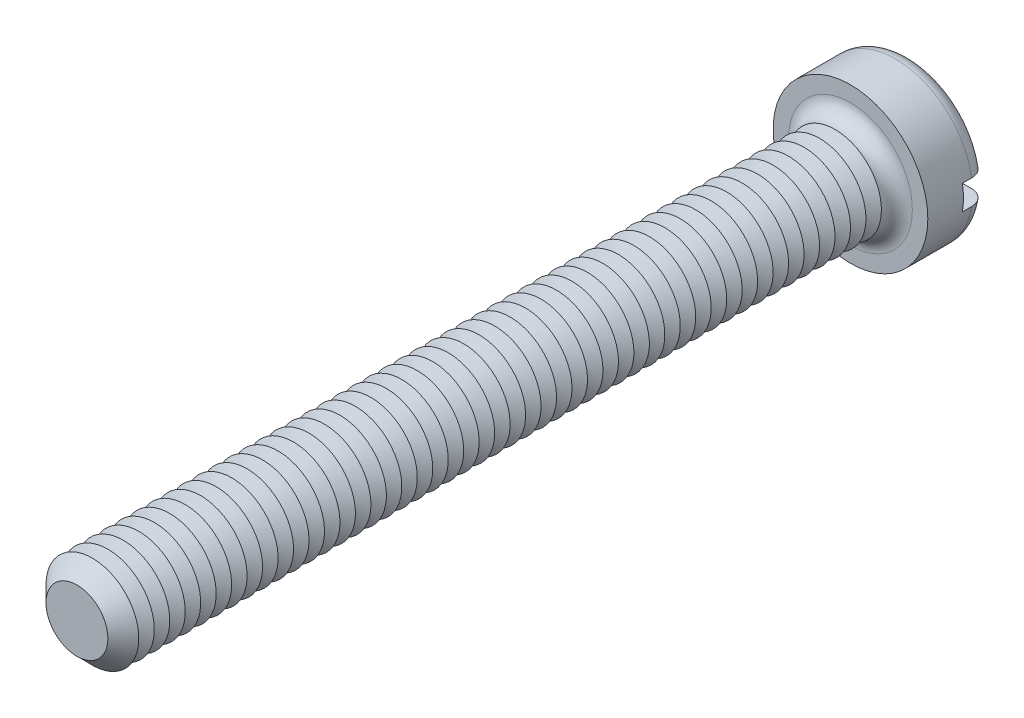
ISO-10303-21;
HEADER;
FILE_DESCRIPTION(('STEP AP214'),'2;1');
FILE_NAME('part.step','',(''),(''),'','','');
FILE_SCHEMA(('AUTOMOTIVE_DESIGN { 1 0 10303 214 1 1 1 1 }'));
ENDSEC;
DATA;
#1=APPLICATION_CONTEXT('core data for automotive mechanical design processes');
#2=APPLICATION_PROTOCOL_DEFINITION('international standard','automotive_design',2000,#1);
#3=PRODUCT_CONTEXT('',#1,'mechanical');
#4=PRODUCT('Part','Part','',(#3));
#5=PRODUCT_RELATED_PRODUCT_CATEGORY('part','',(#4));
#6=PRODUCT_DEFINITION_FORMATION('','',#4);
#7=PRODUCT_DEFINITION_CONTEXT('part definition',#1,'design');
#8=PRODUCT_DEFINITION('design','',#6,#7);
#9=PRODUCT_DEFINITION_SHAPE('','',#8);
#10=(LENGTH_UNIT() NAMED_UNIT(*) SI_UNIT(.MILLI.,.METRE.));
#11=(NAMED_UNIT(*) PLANE_ANGLE_UNIT() SI_UNIT($,.RADIAN.));
#12=(NAMED_UNIT(*) SI_UNIT($,.STERADIAN.) SOLID_ANGLE_UNIT());
#13=UNCERTAINTY_MEASURE_WITH_UNIT(LENGTH_MEASURE(1.E-05),#10,'distance_accuracy_value','');
#14=(GEOMETRIC_REPRESENTATION_CONTEXT(3) GLOBAL_UNCERTAINTY_ASSIGNED_CONTEXT((#13)) GLOBAL_UNIT_ASSIGNED_CONTEXT((#10,
#11,#12)) REPRESENTATION_CONTEXT('',''));
#15=CARTESIAN_POINT('',(0.,0.,0.));
#16=DIRECTION('',(0.,0.,1.));
#17=DIRECTION('',(1.,0.,0.));
#18=AXIS2_PLACEMENT_3D('',#15,#16,#17);
#19=CARTESIAN_POINT('',(0.,0.,-3.9));
#20=DIRECTION('',(0.,0.,1.));
#21=DIRECTION('',(1.,0.,0.));
#22=AXIS2_PLACEMENT_3D('',#19,#20,#21);
#23=PLANE('',#22);
#24=CARTESIAN_POINT('',(0.,0.,-3.9));
#25=DIRECTION('',(0.,0.,1.));
#26=DIRECTION('',(1.,0.,0.));
#27=AXIS2_PLACEMENT_3D('',#24,#25,#26);
#28=CIRCLE('',#27,4.);
#29=CARTESIAN_POINT('',(-3.91918358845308,0.800000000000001,-3.9));
#30=VERTEX_POINT('',#29);
#31=CARTESIAN_POINT('',(3.91918358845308,0.8,-3.9));
#32=VERTEX_POINT('',#31);
#33=EDGE_CURVE('E116',#30,#32,#28,.F.);
#34=ORIENTED_EDGE('',*,*,#33,.T.);
#35=DIRECTION('',(1.,0.,0.));
#36=VECTOR('',#35,1.);
#37=CARTESIAN_POINT('',(-5.,0.800000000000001,-3.9));
#38=LINE('',#37,#36);
#39=EDGE_CURVE('E111',#30,#32,#38,.T.);
#40=ORIENTED_EDGE('',*,*,#39,.F.);
#41=EDGE_LOOP('',(#34,#40));
#42=FACE_BOUND('',#41,.T.);
#43=ADVANCED_FACE('F39',(#42),#23,.F.);
#44=CARTESIAN_POINT('',(0.,0.,-2.9));
#45=DIRECTION('',(0.,0.,1.));
#46=DIRECTION('',(1.,0.,0.));
#47=AXIS2_PLACEMENT_3D('',#44,#45,#46);
#48=TOROIDAL_SURFACE('',#47,4.,1.);
#49=CARTESIAN_POINT('',(-4.76648512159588,0.800000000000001,-3.45304061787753));
#50=CARTESIAN_POINT('',(-4.73486405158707,0.800000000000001,-3.50001565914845));
#51=CARTESIAN_POINT('',(-4.69920787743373,0.800000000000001,-3.54432871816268));
#52=CARTESIAN_POINT('',(-4.62090302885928,0.800000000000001,-3.62634638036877));
#53=CARTESIAN_POINT('',(-4.57824494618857,0.800000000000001,-3.66404194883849));
#54=CARTESIAN_POINT('',(-4.48726975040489,0.800000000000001,-3.73172278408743));
#55=CARTESIAN_POINT('',(-4.43895902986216,0.800000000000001,-3.76171664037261));
#56=CARTESIAN_POINT('',(-4.33804923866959,0.800000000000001,-3.81326437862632));
#57=CARTESIAN_POINT('',(-4.2854512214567,0.800000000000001,-3.8348203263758));
#58=CARTESIAN_POINT('',(-4.17679895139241,0.800000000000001,-3.86918431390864));
#59=CARTESIAN_POINT('',(-4.12071163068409,0.800000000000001,-3.88188775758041));
#60=CARTESIAN_POINT('',(-4.00720729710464,0.800000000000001,-3.89785932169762));
#61=CARTESIAN_POINT('',(-3.94979011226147,0.800000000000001,-3.9011262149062));
#62=CARTESIAN_POINT('',(-3.83429042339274,0.800000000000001,-3.89816676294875));
#63=CARTESIAN_POINT('',(-3.77621176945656,0.800000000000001,-3.89178937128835));
#64=CARTESIAN_POINT('',(-3.66191938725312,0.800000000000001,-3.8694726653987));
#65=CARTESIAN_POINT('',(-3.60570580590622,0.800000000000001,-3.85353259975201));
#66=CARTESIAN_POINT('',(-3.49618749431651,0.800000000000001,-3.81233202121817));
#67=CARTESIAN_POINT('',(-3.44291561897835,0.800000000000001,-3.78698406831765));
#68=CARTESIAN_POINT('',(-3.34140774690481,0.800000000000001,-3.72766098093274));
#69=CARTESIAN_POINT('',(-3.29317182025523,0.800000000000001,-3.69368572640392));
#70=CARTESIAN_POINT('',(-3.20343355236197,0.800000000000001,-3.6182054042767));
#71=CARTESIAN_POINT('',(-3.16189680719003,0.800000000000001,-3.57674128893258));
#72=CARTESIAN_POINT('',(-3.08658236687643,0.800000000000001,-3.48727547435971));
#73=CARTESIAN_POINT('',(-3.05280364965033,0.800000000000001,-3.43927463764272));
#74=CARTESIAN_POINT('',(-2.99489532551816,0.800000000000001,-3.33932895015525));
#75=CARTESIAN_POINT('',(-2.97055012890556,0.800000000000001,-3.28750911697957));
#76=CARTESIAN_POINT('',(-2.93124252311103,0.800000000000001,-3.18042600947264));
#77=CARTESIAN_POINT('',(-2.91627793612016,0.800000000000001,-3.12516353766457));
#78=CARTESIAN_POINT('',(-2.89663075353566,0.800000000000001,-3.01470560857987));
#79=CARTESIAN_POINT('',(-2.89162828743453,0.800000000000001,-2.95956691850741));
#80=CARTESIAN_POINT('',(-2.89112479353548,0.800000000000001,-2.84924961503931));
#81=CARTESIAN_POINT('',(-2.89562264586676,0.800000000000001,-2.79407100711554));
#82=CARTESIAN_POINT('',(-2.91379565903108,0.800000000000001,-2.6861912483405));
#83=CARTESIAN_POINT('',(-2.92731815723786,0.800000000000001,-2.63346424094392));
#84=CARTESIAN_POINT('',(-2.96290888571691,0.800000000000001,-2.53098203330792));
#85=CARTESIAN_POINT('',(-2.98497757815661,0.800000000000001,-2.48122699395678));
#86=CARTESIAN_POINT('',(-3.03728055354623,0.800000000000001,-2.38535286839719));
#87=CARTESIAN_POINT('',(-3.06761989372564,0.800000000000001,-2.33929117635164));
#88=CARTESIAN_POINT('',(-3.13537950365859,0.800000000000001,-2.2527125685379));
#89=CARTESIAN_POINT('',(-3.17280082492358,0.800000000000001,-2.21219647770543));
#90=CARTESIAN_POINT('',(-3.2549164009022,0.800000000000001,-2.13651195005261));
#91=CARTESIAN_POINT('',(-3.29980186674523,0.800000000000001,-2.10155095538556));
#92=CARTESIAN_POINT('',(-3.39467666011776,0.800000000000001,-2.03942270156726));
#93=CARTESIAN_POINT('',(-3.44466673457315,0.800000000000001,-2.01225658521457));
#94=CARTESIAN_POINT('',(-3.5497933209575,0.800000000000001,-1.96576935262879));
#95=CARTESIAN_POINT('',(-3.60503228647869,0.800000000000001,-1.94667963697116));
#96=CARTESIAN_POINT('',(-3.71791613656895,0.800000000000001,-1.91794308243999));
#97=CARTESIAN_POINT('',(-3.77556119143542,0.800000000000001,-1.90829691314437));
#98=CARTESIAN_POINT('',(-3.89221522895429,0.800000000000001,-1.89869331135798));
#99=CARTESIAN_POINT('',(-3.9512319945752,0.800000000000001,-1.89882985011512));
#100=CARTESIAN_POINT('',(-4.06839541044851,0.800000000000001,-1.90907818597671));
#101=CARTESIAN_POINT('',(-4.12654207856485,0.800000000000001,-1.91918977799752));
#102=CARTESIAN_POINT('',(-4.23988103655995,0.800000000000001,-1.9490667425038));
#103=CARTESIAN_POINT('',(-4.29509069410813,0.800000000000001,-1.96876615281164));
#104=CARTESIAN_POINT('',(-4.40134194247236,0.800000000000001,-2.01729572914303));
#105=CARTESIAN_POINT('',(-4.45238383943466,0.800000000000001,-2.04612522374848));
#106=CARTESIAN_POINT('',(-4.54801343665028,0.800000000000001,-2.1116316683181));
#107=CARTESIAN_POINT('',(-4.59268768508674,0.800000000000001,-2.14818225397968));
#108=CARTESIAN_POINT('',(-4.67513924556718,0.800000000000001,-2.22837632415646));
#109=CARTESIAN_POINT('',(-4.71291715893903,0.800000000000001,-2.27201918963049));
#110=CARTESIAN_POINT('',(-4.77986554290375,0.800000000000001,-2.36439990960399));
#111=CARTESIAN_POINT('',(-4.80916462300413,0.800000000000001,-2.41304457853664));
#112=CARTESIAN_POINT('',(-4.85906149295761,0.800000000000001,-2.51460659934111));
#113=CARTESIAN_POINT('',(-4.8796602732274,0.800000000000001,-2.56752346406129));
#114=CARTESIAN_POINT('',(-4.9113264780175,0.800000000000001,-2.67542592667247));
#115=CARTESIAN_POINT('',(-4.92250819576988,0.800000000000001,-2.73037800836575));
#116=CARTESIAN_POINT('',(-4.93542682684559,0.800000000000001,-2.84139649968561));
#117=CARTESIAN_POINT('',(-4.93716171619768,0.800000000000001,-2.89746314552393));
#118=CARTESIAN_POINT('',(-4.93114851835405,0.800000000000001,-3.00876455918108));
#119=CARTESIAN_POINT('',(-4.92345325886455,0.800000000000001,-3.0640022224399));
#120=CARTESIAN_POINT('',(-4.8989032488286,0.800000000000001,-3.17235240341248));
#121=CARTESIAN_POINT('',(-4.88205998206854,0.800000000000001,-3.22546749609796));
#122=CARTESIAN_POINT('',(-4.84819200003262,0.800000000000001,-3.30764066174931));
#123=CARTESIAN_POINT('',(-4.83390853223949,0.800000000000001,-3.33785845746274));
#124=CARTESIAN_POINT('',(-4.80237957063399,0.800000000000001,-3.39670633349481));
#125=CARTESIAN_POINT('',(-4.78513409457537,0.800000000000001,-3.42533642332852));
#126=CARTESIAN_POINT('',(-4.76648512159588,0.800000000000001,-3.45304061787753));
#127=B_SPLINE_CURVE_WITH_KNOTS('',3,(#49,#50,#51,#52,#53,#54,#55,#56,#57,#58,#59,#60,#61,#62,
#63,#64,#65,#66,#67,#68,#69,#70,#71,#72,#73,#74,#75,#76,#77,#78,#79,#80,#81,#82,#83,#84,#85,#86,
#87,#88,#89,#90,#91,#92,#93,#94,#95,#96,#97,#98,#99,#100,#101,#102,#103,#104,#105,#106,#107,
#108,#109,#110,#111,#112,#113,#114,#115,#116,#117,#118,#119,#120,#121,#122,#123,#124,#125,#126),
.UNSPECIFIED.,.T.,.F.,(4,2,2,2,2,2,2,2,2,2,2,2,2,2,2,2,2,2,2,2,2,2,2,2,2,2,2,2,2,2,2,2,2,2,2,2,
2,2,4),(0.,0.169755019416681,0.339740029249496,0.509534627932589,0.67928763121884,
0.851013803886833,1.02276230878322,1.19722869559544,1.37170879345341,1.54785292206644,
1.72399950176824,1.89921049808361,2.07439839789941,2.24530597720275,2.41617386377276,
2.58146078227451,2.74672821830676,2.90926852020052,3.0718176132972,3.2365363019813,
3.40127946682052,3.57118676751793,3.74111896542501,3.91563534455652,4.09016409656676,
4.26636956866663,4.4425714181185,4.61757781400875,4.79257134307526,4.96489650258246,
5.13720662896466,5.30674670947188,5.47626748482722,5.64369988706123,5.81116816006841,
5.97770254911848,6.14402836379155,6.24414438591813,6.34425980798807),.UNSPECIFIED.);
#128=CARTESIAN_POINT('',(-4.93558507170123,0.800000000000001,-2.9));
#129=VERTEX_POINT('',#128);
#130=EDGE_CURVE('E563',#129,#30,#127,.T.);
#131=ORIENTED_EDGE('',*,*,#130,.F.);
#132=CARTESIAN_POINT('',(0.,0.,-2.9));
#133=DIRECTION('',(0.,0.,1.));
#134=DIRECTION('',(1.,0.,0.));
#135=AXIS2_PLACEMENT_3D('',#132,#133,#134);
#136=CIRCLE('',#135,5.);
#137=CARTESIAN_POINT('',(4.93558507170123,0.8,-2.9));
#138=VERTEX_POINT('',#137);
#139=EDGE_CURVE('E125',#138,#129,#136,.T.);
#140=ORIENTED_EDGE('',*,*,#139,.F.);
#141=CARTESIAN_POINT('',(2.98553785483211,0.8,-3.31649797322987));
#142=CARTESIAN_POINT('',(3.00991125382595,0.8,-3.36788093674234));
#143=CARTESIAN_POINT('',(3.03875556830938,0.8,-3.41719756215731));
#144=CARTESIAN_POINT('',(3.1043993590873,0.8,-3.51028676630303));
#145=CARTESIAN_POINT('',(3.1412115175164,0.8,-3.55405032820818));
#146=CARTESIAN_POINT('',(3.22153641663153,0.8,-3.63476402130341));
#147=CARTESIAN_POINT('',(3.26503706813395,0.8,-3.67172618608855));
#148=CARTESIAN_POINT('',(3.35749627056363,0.8,-3.73799476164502));
#149=CARTESIAN_POINT('',(3.4064533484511,0.8,-3.76730323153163));
#150=CARTESIAN_POINT('',(3.5095773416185,0.8,-3.81809642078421));
#151=CARTESIAN_POINT('',(3.56383317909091,0.8,-3.83940072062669));
#152=CARTESIAN_POINT('',(3.67513017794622,0.8,-3.87272481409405));
#153=CARTESIAN_POINT('',(3.7321717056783,0.8,-3.88474338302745));
#154=CARTESIAN_POINT('',(3.84815688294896,0.8,-3.89923413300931));
#155=CARTESIAN_POINT('',(3.90711516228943,0.8,-3.9015896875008));
#156=CARTESIAN_POINT('',(4.02458610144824,0.8,-3.89631753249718));
#157=CARTESIAN_POINT('',(4.08309876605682,0.8,-3.8886899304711));
#158=CARTESIAN_POINT('',(4.19768646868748,0.8,-3.86366584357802));
#159=CARTESIAN_POINT('',(4.25377243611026,0.8,-3.84631948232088));
#160=CARTESIAN_POINT('',(4.3621676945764,0.8,-3.80231797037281));
#161=CARTESIAN_POINT('',(4.41447726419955,0.8,-3.77566350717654));
#162=CARTESIAN_POINT('',(4.51300872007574,0.8,-3.71421163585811));
#163=CARTESIAN_POINT('',(4.5593085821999,0.8,-3.67953927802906));
#164=CARTESIAN_POINT('',(4.64530675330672,0.8,-3.60279495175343));
#165=CARTESIAN_POINT('',(4.68500564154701,0.8,-3.56072363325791));
#166=CARTESIAN_POINT('',(4.75599202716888,0.8,-3.47111750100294));
#167=CARTESIAN_POINT('',(4.7874061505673,0.8,-3.42368298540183));
#168=CARTESIAN_POINT('',(4.84170328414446,0.8,-3.32415927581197));
#169=CARTESIAN_POINT('',(4.86458695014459,0.8,-3.2720704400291));
#170=CARTESIAN_POINT('',(4.90088120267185,0.8,-3.16544016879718));
#171=CARTESIAN_POINT('',(4.91440984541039,0.8,-3.11093889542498));
#172=CARTESIAN_POINT('',(4.93205429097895,0.8,-3.00043391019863));
#173=CARTESIAN_POINT('',(4.93617053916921,0.8,-2.9444302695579));
#174=CARTESIAN_POINT('',(4.93486973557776,0.8,-2.83292218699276));
#175=CARTESIAN_POINT('',(4.92951827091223,0.8,-2.77741696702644));
#176=CARTESIAN_POINT('',(4.90957104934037,0.8,-2.66809456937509));
#177=CARTESIAN_POINT('',(4.89497541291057,0.8,-2.61427736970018));
#178=CARTESIAN_POINT('',(4.85697876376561,0.8,-2.50985095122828));
#179=CARTESIAN_POINT('',(4.83357805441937,0.8,-2.45924162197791));
#180=CARTESIAN_POINT('',(4.77866660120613,0.8,-2.36263484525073));
#181=CARTESIAN_POINT('',(4.74715567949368,0.8,-2.31663749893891));
#182=CARTESIAN_POINT('',(4.67670791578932,0.8,-2.23021464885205));
#183=CARTESIAN_POINT('',(4.6377224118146,0.8,-2.1898288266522));
#184=CARTESIAN_POINT('',(4.55359880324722,0.8,-2.11607828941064));
#185=CARTESIAN_POINT('',(4.50846036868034,0.8,-2.08271395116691));
#186=CARTESIAN_POINT('',(4.41271544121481,0.8,-2.02349513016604));
#187=CARTESIAN_POINT('',(4.36204749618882,0.8,-1.99774003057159));
#188=CARTESIAN_POINT('',(4.257155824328,0.8,-1.95495040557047));
#189=CARTESIAN_POINT('',(4.20293181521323,0.8,-1.93791657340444));
#190=CARTESIAN_POINT('',(4.09154156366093,0.8,-1.91276335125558));
#191=CARTESIAN_POINT('',(4.03434212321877,0.8,-1.90479098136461));
#192=CARTESIAN_POINT('',(3.91941228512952,0.8,-1.89840884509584));
#193=CARTESIAN_POINT('',(3.8616818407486,0.8,-1.89999992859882));
#194=CARTESIAN_POINT('',(3.7464111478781,0.8,-1.91275144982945));
#195=CARTESIAN_POINT('',(3.6888866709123,0.8,-1.92405471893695));
#196=CARTESIAN_POINT('',(3.57652290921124,0.8,-1.95609086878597));
#197=CARTESIAN_POINT('',(3.52168382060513,0.8,-1.97682443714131));
#198=CARTESIAN_POINT('',(3.41589179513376,0.8,-2.02733294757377));
#199=CARTESIAN_POINT('',(3.36496676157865,0.8,-2.05716640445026));
#200=CARTESIAN_POINT('',(3.26890903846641,0.8,-2.12504079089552));
#201=CARTESIAN_POINT('',(3.22377627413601,0.8,-2.16308161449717));
#202=CARTESIAN_POINT('',(3.141135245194,0.8,-2.24593284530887));
#203=CARTESIAN_POINT('',(3.1035541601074,0.8,-2.29067053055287));
#204=CARTESIAN_POINT('',(3.03669700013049,0.8,-2.38597317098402));
#205=CARTESIAN_POINT('',(3.00741914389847,0.8,-2.43653687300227));
#206=CARTESIAN_POINT('',(2.95891799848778,0.8,-2.54052959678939));
#207=CARTESIAN_POINT('',(2.93943249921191,0.8,-2.59383627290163));
#208=CARTESIAN_POINT('',(2.9100081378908,0.8,-2.70303736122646));
#209=CARTESIAN_POINT('',(2.90006970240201,0.8,-2.75893188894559));
#210=CARTESIAN_POINT('',(2.89027863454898,0.8,-2.86986958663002));
#211=CARTESIAN_POINT('',(2.89012791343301,0.8,-2.92488680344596));
#212=CARTESIAN_POINT('',(2.89917145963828,0.8,-3.03409648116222));
#213=CARTESIAN_POINT('',(2.90835313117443,0.8,-3.08828995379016));
#214=CARTESIAN_POINT('',(2.92977618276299,0.8,-3.17141652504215));
#215=CARTESIAN_POINT('',(2.93899011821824,0.8,-3.20116372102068));
#216=CARTESIAN_POINT('',(2.96020249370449,0.8,-3.25964614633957));
#217=CARTESIAN_POINT('',(2.97220082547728,0.8,-3.28838141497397));
#218=CARTESIAN_POINT('',(2.98553785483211,0.8,-3.31649797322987));
#219=B_SPLINE_CURVE_WITH_KNOTS('',3,(#141,#142,#143,#144,#145,#146,#147,#148,#149,#150,#151,
#152,#153,#154,#155,#156,#157,#158,#159,#160,#161,#162,#163,#164,#165,#166,#167,#168,#169,#170,
#171,#172,#173,#174,#175,#176,#177,#178,#179,#180,#181,#182,#183,#184,#185,#186,#187,#188,#189,
#190,#191,#192,#193,#194,#195,#196,#197,#198,#199,#200,#201,#202,#203,#204,#205,#206,#207,#208,
#209,#210,#211,#212,#213,#214,#215,#216,#217,#218),.UNSPECIFIED.,.T.,.F.,(4,2,2,2,2,2,2,2,2,2,2,
2,2,2,2,2,2,2,2,2,2,2,2,2,2,2,2,2,2,2,2,2,2,2,2,2,2,2,4),(0.,0.170493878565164,
0.341261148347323,0.511723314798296,0.682139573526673,0.856194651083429,1.03027268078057,
1.20644565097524,1.38261672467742,1.55788746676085,1.73314526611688,1.90583484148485,
2.07850925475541,2.24836742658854,2.41821253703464,2.58587311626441,2.75352576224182,
2.92002154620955,3.08651516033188,3.25300303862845,3.41949456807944,3.58710926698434,
3.75473295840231,3.92445790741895,4.09419634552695,4.26665110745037,4.43912119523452,
4.61417197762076,4.78923552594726,4.96544940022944,5.1416609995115,5.31608191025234,
5.49046537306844,5.65989063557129,5.82932346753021,5.99359365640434,6.157642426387,
6.250939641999,6.34423323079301),.UNSPECIFIED.);
#220=EDGE_CURVE('E565',#32,#138,#219,.T.);
#221=ORIENTED_EDGE('',*,*,#220,.F.);
#222=ORIENTED_EDGE('',*,*,#33,.F.);
#223=EDGE_LOOP('',(#131,#140,#221,#222));
#224=FACE_BOUND('',#223,.T.);
#225=ADVANCED_FACE('F547',(#224),#48,.T.);
#226=CARTESIAN_POINT('',(0.,0.,-3.9));
#227=DIRECTION('',(0.,0.,1.));
#228=DIRECTION('',(1.,0.,0.));
#229=AXIS2_PLACEMENT_3D('',#226,#227,#228);
#230=CYLINDRICAL_SURFACE('',#229,5.);
#231=DIRECTION('',(0.,0.,1.));
#232=VECTOR('',#231,1.);
#233=CARTESIAN_POINT('',(4.93558507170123,0.8,-3.9));
#234=LINE('',#233,#232);
#235=CARTESIAN_POINT('',(4.93558507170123,0.8,-2.3));
#236=VERTEX_POINT('',#235);
#237=EDGE_CURVE('E580',#138,#236,#234,.T.);
#238=ORIENTED_EDGE('',*,*,#237,.F.);
#239=ORIENTED_EDGE('',*,*,#139,.T.);
#240=DIRECTION('',(0.,0.,1.));
#241=VECTOR('',#240,1.);
#242=CARTESIAN_POINT('',(-4.93558507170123,0.800000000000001,-3.9));
#243=LINE('',#242,#241);
#244=CARTESIAN_POINT('',(-4.93558507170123,0.800000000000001,-2.3));
#245=VERTEX_POINT('',#244);
#246=EDGE_CURVE('E63',#245,#129,#243,.F.);
#247=ORIENTED_EDGE('',*,*,#246,.F.);
#248=CARTESIAN_POINT('',(0.,0.,-2.3));
#249=DIRECTION('',(0.,0.,-1.));
#250=DIRECTION('',(-1.,0.,0.));
#251=AXIS2_PLACEMENT_3D('',#248,#249,#250);
#252=CIRCLE('',#251,5.);
#253=CARTESIAN_POINT('',(-4.93558507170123,-0.799999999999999,-2.3));
#254=VERTEX_POINT('',#253);
#255=EDGE_CURVE('E43',#245,#254,#252,.F.);
#256=ORIENTED_EDGE('',*,*,#255,.T.);
#257=DIRECTION('',(0.,0.,1.));
#258=VECTOR('',#257,1.);
#259=CARTESIAN_POINT('',(-4.93558507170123,-0.799999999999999,-3.9));
#260=LINE('',#259,#258);
#261=CARTESIAN_POINT('',(-4.93558507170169,-0.799999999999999,-2.89999999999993));
#262=VERTEX_POINT('',#261);
#263=EDGE_CURVE('E577',#262,#254,#260,.T.);
#264=ORIENTED_EDGE('',*,*,#263,.F.);
#265=CARTESIAN_POINT('',(4.93558507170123,-0.8,-2.9));
#266=VERTEX_POINT('',#265);
#267=EDGE_CURVE('E127',#262,#266,#136,.T.);
#268=ORIENTED_EDGE('',*,*,#267,.T.);
#269=DIRECTION('',(0.,0.,1.));
#270=VECTOR('',#269,1.);
#271=CARTESIAN_POINT('',(4.93558507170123,-0.8,-3.9));
#272=LINE('',#271,#270);
#273=CARTESIAN_POINT('',(4.93558507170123,-0.8,-2.3));
#274=VERTEX_POINT('',#273);
#275=EDGE_CURVE('E55',#274,#266,#272,.F.);
#276=ORIENTED_EDGE('',*,*,#275,.F.);
#277=EDGE_CURVE('E11',#274,#236,#252,.F.);
#278=ORIENTED_EDGE('',*,*,#277,.T.);
#279=EDGE_LOOP('',(#238,#239,#247,#256,#264,#268,#276,#278));
#280=FACE_BOUND('',#279,.T.);
#281=CARTESIAN_POINT('',(0.,0.,0.));
#282=DIRECTION('',(0.,0.,1.));
#283=DIRECTION('',(1.,0.,0.));
#284=AXIS2_PLACEMENT_3D('',#281,#282,#283);
#285=CIRCLE('',#284,5.);
#286=CARTESIAN_POINT('',(5.,0.,0.));
#287=VERTEX_POINT('',#286);
#288=EDGE_CURVE('E583',#287,#287,#285,.T.);
#289=ORIENTED_EDGE('',*,*,#288,.F.);
#290=EDGE_LOOP('',(#289));
#291=FACE_BOUND('',#290,.T.);
#292=ADVANCED_FACE('F543',(#280,#291),#230,.T.);
#293=CARTESIAN_POINT('',(3.91918358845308,-0.8,-3.9));
#294=VERTEX_POINT('',#293);
#295=CARTESIAN_POINT('',(-3.91918358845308,-0.799999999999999,-3.9));
#296=VERTEX_POINT('',#295);
#297=EDGE_CURVE('E109',#294,#296,#28,.F.);
#298=ORIENTED_EDGE('',*,*,#297,.T.);
#299=DIRECTION('',(-1.,0.,0.));
#300=VECTOR('',#299,1.);
#301=CARTESIAN_POINT('',(-5.,-0.799999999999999,-3.9));
#302=LINE('',#301,#300);
#303=EDGE_CURVE('E96',#294,#296,#302,.T.);
#304=ORIENTED_EDGE('',*,*,#303,.F.);
#305=EDGE_LOOP('',(#298,#304));
#306=FACE_BOUND('',#305,.T.);
#307=ADVANCED_FACE('F108',(#306),#23,.F.);
#308=CARTESIAN_POINT('',(0.,0.,0.));
#309=DIRECTION('',(0.,0.,1.));
#310=DIRECTION('',(1.,0.,0.));
#311=AXIS2_PLACEMENT_3D('',#308,#309,#310);
#312=PLANE('',#311);
#313=CARTESIAN_POINT('',(0.,0.,0.));
#314=DIRECTION('',(0.,0.,1.));
#315=DIRECTION('',(1.,0.,0.));
#316=AXIS2_PLACEMENT_3D('',#313,#314,#315);
#317=CIRCLE('',#316,4.);
#318=CARTESIAN_POINT('',(4.,0.,0.));
#319=VERTEX_POINT('',#318);
#320=EDGE_CURVE('E115',#319,#319,#317,.F.);
#321=ORIENTED_EDGE('',*,*,#320,.T.);
#322=EDGE_LOOP('',(#321));
#323=FACE_BOUND('',#322,.T.);
#324=ORIENTED_EDGE('',*,*,#288,.T.);
#325=EDGE_LOOP('',(#324));
#326=FACE_BOUND('',#325,.T.);
#327=ADVANCED_FACE('F542',(#323,#326),#312,.T.);
#328=CARTESIAN_POINT('',(-4.76648512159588,-0.799999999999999,-3.45304061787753));
#329=CARTESIAN_POINT('',(-4.7975694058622,-0.799999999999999,-3.40685392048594));
#330=CARTESIAN_POINT('',(-4.82479903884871,-0.799999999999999,-3.35802740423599));
#331=CARTESIAN_POINT('',(-4.87070632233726,-0.799999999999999,-3.25646127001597));
#332=CARTESIAN_POINT('',(-4.8893747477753,-0.799999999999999,-3.20371750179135));
#333=CARTESIAN_POINT('',(-4.91756720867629,-0.799999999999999,-3.09584501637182));
#334=CARTESIAN_POINT('',(-4.92709302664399,-0.799999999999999,-3.04071676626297));
#335=CARTESIAN_POINT('',(-4.93671217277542,-0.799999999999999,-2.92965669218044));
#336=CARTESIAN_POINT('',(-4.93680767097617,-0.799999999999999,-2.87372505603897));
#337=CARTESIAN_POINT('',(-4.92758675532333,-0.799999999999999,-2.76284675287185));
#338=CARTESIAN_POINT('',(-4.91830421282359,-0.799999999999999,-2.70789726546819));
#339=CARTESIAN_POINT('',(-4.89065741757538,-0.799999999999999,-2.60033228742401));
#340=CARTESIAN_POINT('',(-4.87229291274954,-0.799999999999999,-2.54771686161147));
#341=CARTESIAN_POINT('',(-4.82699855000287,-0.799999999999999,-2.44622441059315));
#342=CARTESIAN_POINT('',(-4.80005659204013,-0.799999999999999,-2.39735278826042));
#343=CARTESIAN_POINT('',(-4.73841244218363,-0.799999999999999,-2.30477947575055));
#344=CARTESIAN_POINT('',(-4.70371003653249,-0.799999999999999,-2.26107792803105));
#345=CARTESIAN_POINT('',(-4.62724516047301,-0.799999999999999,-2.17969334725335));
#346=CARTESIAN_POINT('',(-4.58542787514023,-0.799999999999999,-2.14206183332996));
#347=CARTESIAN_POINT('',(-4.49614171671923,-0.799999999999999,-2.07424284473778));
#348=CARTESIAN_POINT('',(-4.44867251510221,-0.799999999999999,-2.04405580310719));
#349=CARTESIAN_POINT('',(-4.34875035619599,-0.799999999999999,-1.99153688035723));
#350=CARTESIAN_POINT('',(-4.29623870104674,-0.799999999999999,-1.96931670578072));
#351=CARTESIAN_POINT('',(-4.18826905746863,-0.799999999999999,-1.93384994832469));
#352=CARTESIAN_POINT('',(-4.1328108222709,-0.799999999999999,-1.92060411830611));
#353=CARTESIAN_POINT('',(-4.01956054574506,-0.799999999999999,-1.90323798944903));
#354=CARTESIAN_POINT('',(-3.96174522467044,-0.799999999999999,-1.89926947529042));
#355=CARTESIAN_POINT('',(-3.84625419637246,-0.799999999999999,-1.90095183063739));
#356=CARTESIAN_POINT('',(-3.78857850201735,-0.799999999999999,-1.90660355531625));
#357=CARTESIAN_POINT('',(-3.67415602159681,-0.799999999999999,-1.92748272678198));
#358=CARTESIAN_POINT('',(-3.61743328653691,-0.799999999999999,-1.94284216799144));
#359=CARTESIAN_POINT('',(-3.50734962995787,-0.799999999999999,-1.9828275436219));
#360=CARTESIAN_POINT('',(-3.4539889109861,-0.799999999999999,-2.00745403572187));
#361=CARTESIAN_POINT('',(-3.35197118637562,-0.799999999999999,-2.06542964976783));
#362=CARTESIAN_POINT('',(-3.30333217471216,-0.799999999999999,-2.0988104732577));
#363=CARTESIAN_POINT('',(-3.21244692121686,-0.799999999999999,-2.17337326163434));
#364=CARTESIAN_POINT('',(-3.17020039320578,-0.799999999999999,-2.21455487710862));
#365=CARTESIAN_POINT('',(-3.0940098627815,-0.799999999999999,-2.30296695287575));
#366=CARTESIAN_POINT('',(-3.05995540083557,-0.799999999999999,-2.35010211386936));
#367=CARTESIAN_POINT('',(-3.00053815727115,-0.799999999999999,-2.4495670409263));
#368=CARTESIAN_POINT('',(-2.97517362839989,-0.799999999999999,-2.50189576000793));
#369=CARTESIAN_POINT('',(-2.93470320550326,-0.799999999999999,-2.60853979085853));
#370=CARTESIAN_POINT('',(-2.91930557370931,-0.799999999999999,-2.66274437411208));
#371=CARTESIAN_POINT('',(-2.89812734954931,-0.799999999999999,-2.77299836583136));
#372=CARTESIAN_POINT('',(-2.89234481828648,-0.799999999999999,-2.82904740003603));
#373=CARTESIAN_POINT('',(-2.89064073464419,-0.799999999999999,-2.93970612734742));
#374=CARTESIAN_POINT('',(-2.89444549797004,-0.799999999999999,-2.99431180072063));
#375=CARTESIAN_POINT('',(-2.9112006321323,-0.799999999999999,-3.10209766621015));
#376=CARTESIAN_POINT('',(-2.9241507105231,-0.799999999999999,-3.1552779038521));
#377=CARTESIAN_POINT('',(-2.95868580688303,-0.799999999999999,-3.25858631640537));
#378=CARTESIAN_POINT('',(-2.98024709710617,-0.799999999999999,-3.30872244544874));
#379=CARTESIAN_POINT('',(-3.03128544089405,-0.799999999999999,-3.40478519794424));
#380=CARTESIAN_POINT('',(-3.06076335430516,-0.799999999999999,-3.45071136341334));
#381=CARTESIAN_POINT('',(-3.12753448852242,-0.799999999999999,-3.53826932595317));
#382=CARTESIAN_POINT('',(-3.16500083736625,-0.799999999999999,-3.57976901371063));
#383=CARTESIAN_POINT('',(-3.24617503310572,-0.799999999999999,-3.65613204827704));
#384=CARTESIAN_POINT('',(-3.28988388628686,-0.799999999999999,-3.69099432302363));
#385=CARTESIAN_POINT('',(-3.38380639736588,-0.799999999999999,-3.75424083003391));
#386=CARTESIAN_POINT('',(-3.43418287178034,-0.799999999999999,-3.78238342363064));
#387=CARTESIAN_POINT('',(-3.53887888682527,-0.799999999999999,-3.83000231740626));
#388=CARTESIAN_POINT('',(-3.59319889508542,-0.799999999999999,-3.84947758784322));
#389=CARTESIAN_POINT('',(-3.70539237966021,-0.799999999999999,-3.87954336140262));
#390=CARTESIAN_POINT('',(-3.76331464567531,-0.799999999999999,-3.88995217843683));
#391=CARTESIAN_POINT('',(-3.88008461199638,-0.799999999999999,-3.9009132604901));
#392=CARTESIAN_POINT('',(-3.93893230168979,-0.799999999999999,-3.9014656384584));
#393=CARTESIAN_POINT('',(-4.05594892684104,-0.799999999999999,-3.89264187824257));
#394=CARTESIAN_POINT('',(-4.11411702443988,-0.799999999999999,-3.88325457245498));
#395=CARTESIAN_POINT('',(-4.22802928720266,-0.799999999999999,-3.85472582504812));
#396=CARTESIAN_POINT('',(-4.28377297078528,-0.799999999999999,-3.83558245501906));
#397=CARTESIAN_POINT('',(-4.39054463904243,-0.799999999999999,-3.78829842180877));
#398=CARTESIAN_POINT('',(-4.44161887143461,-0.799999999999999,-3.76026208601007));
#399=CARTESIAN_POINT('',(-4.53818016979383,-0.799999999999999,-3.69589278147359));
#400=CARTESIAN_POINT('',(-4.58367442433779,-0.799999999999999,-3.65957066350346));
#401=CARTESIAN_POINT('',(-4.65208830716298,-0.799999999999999,-3.59453310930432));
#402=CARTESIAN_POINT('',(-4.67711825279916,-0.799999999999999,-3.56800018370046));
#403=CARTESIAN_POINT('',(-4.72414423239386,-0.799999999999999,-3.51236863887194));
#404=CARTESIAN_POINT('',(-4.74614029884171,-0.799999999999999,-3.48327004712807));
#405=CARTESIAN_POINT('',(-4.76648512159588,-0.799999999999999,-3.45304061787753));
#406=B_SPLINE_CURVE_WITH_KNOTS('',3,(#328,#329,#330,#331,#332,#333,#334,#335,#336,#337,#338,
#339,#340,#341,#342,#343,#344,#345,#346,#347,#348,#349,#350,#351,#352,#353,#354,#355,#356,#357,
#358,#359,#360,#361,#362,#363,#364,#365,#366,#367,#368,#369,#370,#371,#372,#373,#374,#375,#376,
#377,#378,#379,#380,#381,#382,#383,#384,#385,#386,#387,#388,#389,#390,#391,#392,#393,#394,#395,
#396,#397,#398,#399,#400,#401,#402,#403,#404,#405),.UNSPECIFIED.,.T.,.F.,(4,2,2,2,2,2,2,2,2,2,2,
2,2,2,2,2,2,2,2,2,2,2,2,2,2,2,2,2,2,2,2,2,2,2,2,2,2,2,4),(0.,0.166886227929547,
0.333951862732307,0.500984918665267,0.667979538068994,0.834373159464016,1.00077139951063,
1.16740542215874,1.33404403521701,1.50202999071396,1.67002571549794,1.84029248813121,
2.01057354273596,2.18362161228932,2.35668506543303,2.53215380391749,2.70763310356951,
2.88375684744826,3.05987270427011,3.23346085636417,3.40701408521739,3.57522519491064,
3.74340238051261,3.90683338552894,4.0702591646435,4.23323770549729,4.39623395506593,
4.56320691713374,4.7302068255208,4.90252468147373,5.07486300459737,5.25058028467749,
5.42629555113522,5.60220844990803,5.77815613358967,5.95211162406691,6.12584060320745,
6.23506966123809,6.34429754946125),.UNSPECIFIED.);
#407=EDGE_CURVE('E103',#296,#262,#406,.T.);
#408=ORIENTED_EDGE('',*,*,#407,.F.);
#409=ORIENTED_EDGE('',*,*,#297,.F.);
#410=CARTESIAN_POINT('',(2.98553785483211,-0.8,-3.31649797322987));
#411=CARTESIAN_POINT('',(2.96216773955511,-0.8,-3.26721849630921));
#412=CARTESIAN_POINT('',(2.94287503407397,-0.8,-3.21596872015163));
#413=CARTESIAN_POINT('',(2.91313258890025,-0.8,-3.11092723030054));
#414=CARTESIAN_POINT('',(2.9026902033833,-0.8,-3.0571334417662));
#415=CARTESIAN_POINT('',(2.89104377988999,-0.8,-2.94853922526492));
#416=CARTESIAN_POINT('',(2.88984130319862,-0.8,-2.89373862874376));
#417=CARTESIAN_POINT('',(2.89672585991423,-0.8,-2.78473646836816));
#418=CARTESIAN_POINT('',(2.90481120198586,-0.8,-2.73053479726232));
#419=CARTESIAN_POINT('',(2.92989134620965,-0.8,-2.62460092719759));
#420=CARTESIAN_POINT('',(2.94682969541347,-0.8,-2.57285532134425));
#421=CARTESIAN_POINT('',(2.9889990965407,-0.8,-2.47286425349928));
#422=CARTESIAN_POINT('',(3.01423103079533,-0.8,-2.42461916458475));
#423=CARTESIAN_POINT('',(3.07271536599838,-0.8,-2.33201565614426));
#424=CARTESIAN_POINT('',(3.10610710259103,-0.8,-2.28774532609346));
#425=CARTESIAN_POINT('',(3.17963417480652,-0.8,-2.205215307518));
#426=CARTESIAN_POINT('',(3.21977054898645,-0.8,-2.16695654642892));
#427=CARTESIAN_POINT('',(3.3070361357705,-0.8,-2.09624274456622));
#428=CARTESIAN_POINT('',(3.35434874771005,-0.8,-2.06401396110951));
#429=CARTESIAN_POINT('',(3.45361131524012,-0.8,-2.00773436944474));
#430=CARTESIAN_POINT('',(3.50556189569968,-0.8,-1.98368466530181));
#431=CARTESIAN_POINT('',(3.61398433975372,-0.8,-1.94389460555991));
#432=CARTESIAN_POINT('',(3.67053506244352,-0.8,-1.92836880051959));
#433=CARTESIAN_POINT('',(3.78543606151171,-0.8,-1.90696594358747));
#434=CARTESIAN_POINT('',(3.84378643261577,-0.8,-1.90108940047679));
#435=CARTESIAN_POINT('',(3.96100201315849,-0.8,-1.89918115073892));
#436=CARTESIAN_POINT('',(4.01986821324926,-0.8,-1.90320860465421));
#437=CARTESIAN_POINT('',(4.13606891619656,-0.8,-1.9211820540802));
#438=CARTESIAN_POINT('',(4.19340347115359,-0.8,-1.93512771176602));
#439=CARTESIAN_POINT('',(4.30434213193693,-0.8,-1.97243705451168));
#440=CARTESIAN_POINT('',(4.35797549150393,-0.8,-1.99571368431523));
#441=CARTESIAN_POINT('',(4.46048254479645,-0.8,-2.0510826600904));
#442=CARTESIAN_POINT('',(4.50935662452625,-0.8,-2.08317429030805));
#443=CARTESIAN_POINT('',(4.60012348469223,-0.8,-2.15471647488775));
#444=CARTESIAN_POINT('',(4.64211506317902,-0.8,-2.19404167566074));
#445=CARTESIAN_POINT('',(4.71877054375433,-0.8,-2.27928299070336));
#446=CARTESIAN_POINT('',(4.75343508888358,-0.8,-2.32519852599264));
#447=CARTESIAN_POINT('',(4.81388799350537,-0.8,-2.4215411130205));
#448=CARTESIAN_POINT('',(4.83980652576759,-0.8,-2.47188650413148));
#449=CARTESIAN_POINT('',(4.88271402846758,-0.8,-2.57624865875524));
#450=CARTESIAN_POINT('',(4.89970360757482,-0.8,-2.63026517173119));
#451=CARTESIAN_POINT('',(4.92409334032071,-0.8,-2.73978844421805));
#452=CARTESIAN_POINT('',(4.93159814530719,-0.8,-2.79527191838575));
#453=CARTESIAN_POINT('',(4.93713723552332,-0.8,-2.90670881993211));
#454=CARTESIAN_POINT('',(4.9351718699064,-0.8,-2.9626622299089));
#455=CARTESIAN_POINT('',(4.92186293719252,-0.8,-3.07317093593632));
#456=CARTESIAN_POINT('',(4.91056393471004,-0.8,-3.12773160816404));
#457=CARTESIAN_POINT('',(4.87898532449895,-0.8,-3.234187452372));
#458=CARTESIAN_POINT('',(4.85870572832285,-0.8,-3.28608262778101));
#459=CARTESIAN_POINT('',(4.80971634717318,-0.8,-3.38586723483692));
#460=CARTESIAN_POINT('',(4.78098824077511,-0.8,-3.43374766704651));
#461=CARTESIAN_POINT('',(4.71596686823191,-0.8,-3.52405937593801));
#462=CARTESIAN_POINT('',(4.67967336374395,-0.8,-3.56649048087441));
#463=CARTESIAN_POINT('',(4.60022577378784,-0.8,-3.64511036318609));
#464=CARTESIAN_POINT('',(4.5570143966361,-0.8,-3.6812412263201));
#465=CARTESIAN_POINT('',(4.4652099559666,-0.8,-3.7458530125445));
#466=CARTESIAN_POINT('',(4.41661654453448,-0.8,-3.77433344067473));
#467=CARTESIAN_POINT('',(4.31470683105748,-0.8,-3.82326981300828));
#468=CARTESIAN_POINT('',(4.26133399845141,-0.8,-3.84360800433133));
#469=CARTESIAN_POINT('',(4.15196444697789,-0.8,-3.87519515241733));
#470=CARTESIAN_POINT('',(4.09596750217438,-0.8,-3.88644332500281));
#471=CARTESIAN_POINT('',(3.98196469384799,-0.8,-3.89971870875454));
#472=CARTESIAN_POINT('',(3.92394096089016,-0.8,-3.901592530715));
#473=CARTESIAN_POINT('',(3.8083852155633,-0.8,-3.89570840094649));
#474=CARTESIAN_POINT('',(3.75085322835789,-0.8,-3.88794995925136));
#475=CARTESIAN_POINT('',(3.6371167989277,-0.8,-3.86287824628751));
#476=CARTESIAN_POINT('',(3.58093962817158,-0.8,-3.84544111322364));
#477=CARTESIAN_POINT('',(3.47227948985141,-0.8,-3.80139971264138));
#478=CARTESIAN_POINT('',(3.41979762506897,-0.8,-3.77479272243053));
#479=CARTESIAN_POINT('',(3.31994061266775,-0.8,-3.71304199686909));
#480=CARTESIAN_POINT('',(3.27257854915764,-0.8,-3.67787710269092));
#481=CARTESIAN_POINT('',(3.18459619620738,-0.8,-3.59999704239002));
#482=CARTESIAN_POINT('',(3.14396747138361,-0.8,-3.55729146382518));
#483=CARTESIAN_POINT('',(3.08341110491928,-0.8,-3.48140072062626));
#484=CARTESIAN_POINT('',(3.06118126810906,-0.8,-3.45002448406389));
#485=CARTESIAN_POINT('',(3.02047302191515,-0.8,-3.38492378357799));
#486=CARTESIAN_POINT('',(3.00199451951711,-0.8,-3.35119937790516));
#487=CARTESIAN_POINT('',(2.98553785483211,-0.8,-3.31649797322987));
#488=B_SPLINE_CURVE_WITH_KNOTS('',3,(#410,#411,#412,#413,#414,#415,#416,#417,#418,#419,#420,
#421,#422,#423,#424,#425,#426,#427,#428,#429,#430,#431,#432,#433,#434,#435,#436,#437,#438,#439,
#440,#441,#442,#443,#444,#445,#446,#447,#448,#449,#450,#451,#452,#453,#454,#455,#456,#457,#458,
#459,#460,#461,#462,#463,#464,#465,#466,#467,#468,#469,#470,#471,#472,#473,#474,#475,#476,#477,
#478,#479,#480,#481,#482,#483,#484,#485,#486,#487),.UNSPECIFIED.,.T.,.F.,(4,2,2,2,2,2,2,2,2,2,2,
2,2,2,2,2,2,2,2,2,2,2,2,2,2,2,2,2,2,2,2,2,2,2,2,2,2,2,4),(0.,0.163484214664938,
0.327104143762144,0.490751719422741,0.654369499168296,0.816956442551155,0.979560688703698,
1.14516376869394,1.31079237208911,1.48174839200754,1.6527274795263,1.82783306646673,
2.00294788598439,2.17911127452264,2.35526866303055,2.52981944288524,2.70435605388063,
2.87611266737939,3.04785420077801,3.21691347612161,3.38596122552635,3.55312700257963,
3.72028661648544,3.88665268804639,4.053018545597,4.2197478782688,4.38648246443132,
4.55467705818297,4.72288253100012,4.89343959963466,5.06401138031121,5.23736524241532,
5.41072792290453,5.58636211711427,5.76204850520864,5.93817375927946,6.11407667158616,
6.22920111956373,6.34432271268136),.UNSPECIFIED.);
#489=EDGE_CURVE('E92',#266,#294,#488,.T.);
#490=ORIENTED_EDGE('',*,*,#489,.F.);
#491=ORIENTED_EDGE('',*,*,#267,.F.);
#492=EDGE_LOOP('',(#408,#409,#490,#491));
#493=FACE_BOUND('',#492,.T.);
#494=ADVANCED_FACE('F113',(#493),#48,.T.);
#495=CARTESIAN_POINT('',(0.,0.,1.));
#496=DIRECTION('',(0.,0.,1.));
#497=DIRECTION('',(1.,0.,0.));
#498=AXIS2_PLACEMENT_3D('',#495,#496,#497);
#499=TOROIDAL_SURFACE('',#498,4.,1.);
#500=ORIENTED_EDGE('',*,*,#320,.F.);
#501=EDGE_LOOP('',(#500));
#502=FACE_BOUND('',#501,.T.);
#503=CARTESIAN_POINT('',(0.,0.,1.00000000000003));
#504=DIRECTION('',(0.,0.,-1.));
#505=DIRECTION('',(-1.,0.,0.));
#506=AXIS2_PLACEMENT_3D('',#503,#504,#505);
#507=CIRCLE('',#506,3.);
#508=CARTESIAN_POINT('',(-3.,0.,1.00000000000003));
#509=VERTEX_POINT('',#508);
#510=EDGE_CURVE('E589',#509,#509,#507,.T.);
#511=ORIENTED_EDGE('',*,*,#510,.T.);
#512=EDGE_LOOP('',(#511));
#513=FACE_BOUND('',#512,.T.);
#514=ADVANCED_FACE('F535',(#502,#513),#499,.F.);
#515=CARTESIAN_POINT('',(0.,0.,1.50000000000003));
#516=DIRECTION('',(0.,0.,-1.));
#517=DIRECTION('',(-1.,0.,0.));
#518=AXIS2_PLACEMENT_3D('',#515,#516,#517);
#519=CONICAL_SURFACE('',#518,2.13397459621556,1.0471975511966);
#520=ORIENTED_EDGE('',*,*,#510,.F.);
#521=EDGE_LOOP('',(#520));
#522=FACE_BOUND('',#521,.T.);
#523=CARTESIAN_POINT('',(0.,0.,1.50000000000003));
#524=DIRECTION('',(0.,0.,-1.));
#525=DIRECTION('',(-1.,0.,0.));
#526=AXIS2_PLACEMENT_3D('',#523,#524,#525);
#527=CIRCLE('',#526,2.13397459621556);
#528=CARTESIAN_POINT('',(-2.13397459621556,0.,1.50000000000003));
#529=VERTEX_POINT('',#528);
#530=EDGE_CURVE('E596',#529,#529,#527,.T.);
#531=ORIENTED_EDGE('',*,*,#530,.T.);
#532=EDGE_LOOP('',(#531));
#533=FACE_BOUND('',#532,.T.);
#534=ADVANCED_FACE('F531',(#522,#533),#519,.T.);
#535=CARTESIAN_POINT('',(0.,0.,2.00000000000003));
#536=DIRECTION('',(0.,0.,1.));
#537=DIRECTION('',(1.,0.,0.));
#538=AXIS2_PLACEMENT_3D('',#535,#536,#537);
#539=CONICAL_SURFACE('',#538,3.,1.0471975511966);
#540=ORIENTED_EDGE('',*,*,#530,.F.);
#541=EDGE_LOOP('',(#540));
#542=FACE_BOUND('',#541,.T.);
#543=CARTESIAN_POINT('',(0.,0.,2.00000000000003));
#544=DIRECTION('',(0.,0.,-1.));
#545=DIRECTION('',(-1.,0.,0.));
#546=AXIS2_PLACEMENT_3D('',#543,#544,#545);
#547=CIRCLE('',#546,3.);
#548=CARTESIAN_POINT('',(-3.,0.,2.00000000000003));
#549=VERTEX_POINT('',#548);
#550=EDGE_CURVE('E602',#549,#549,#547,.T.);
#551=ORIENTED_EDGE('',*,*,#550,.T.);
#552=EDGE_LOOP('',(#551));
#553=FACE_BOUND('',#552,.T.);
#554=ADVANCED_FACE('F527',(#542,#553),#539,.T.);
#555=CARTESIAN_POINT('',(0.,0.,2.50000000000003));
#556=DIRECTION('',(0.,0.,-1.));
#557=DIRECTION('',(-1.,0.,0.));
#558=AXIS2_PLACEMENT_3D('',#555,#556,#557);
#559=CONICAL_SURFACE('',#558,2.13397459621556,1.0471975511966);
#560=ORIENTED_EDGE('',*,*,#550,.F.);
#561=EDGE_LOOP('',(#560));
#562=FACE_BOUND('',#561,.T.);
#563=CARTESIAN_POINT('',(0.,0.,2.50000000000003));
#564=DIRECTION('',(0.,0.,-1.));
#565=DIRECTION('',(-1.,0.,0.));
#566=AXIS2_PLACEMENT_3D('',#563,#564,#565);
#567=CIRCLE('',#566,2.13397459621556);
#568=CARTESIAN_POINT('',(-2.13397459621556,0.,2.50000000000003));
#569=VERTEX_POINT('',#568);
#570=EDGE_CURVE('E605',#569,#569,#567,.T.);
#571=ORIENTED_EDGE('',*,*,#570,.T.);
#572=EDGE_LOOP('',(#571));
#573=FACE_BOUND('',#572,.T.);
#574=ADVANCED_FACE('F523',(#562,#573),#559,.T.);
#575=CARTESIAN_POINT('',(0.,0.,3.00000000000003));
#576=DIRECTION('',(0.,0.,1.));
#577=DIRECTION('',(1.,0.,0.));
#578=AXIS2_PLACEMENT_3D('',#575,#576,#577);
#579=CONICAL_SURFACE('',#578,3.,1.0471975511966);
#580=ORIENTED_EDGE('',*,*,#570,.F.);
#581=EDGE_LOOP('',(#580));
#582=FACE_BOUND('',#581,.T.);
#583=CARTESIAN_POINT('',(0.,0.,3.00000000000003));
#584=DIRECTION('',(0.,0.,-1.));
#585=DIRECTION('',(-1.,0.,0.));
#586=AXIS2_PLACEMENT_3D('',#583,#584,#585);
#587=CIRCLE('',#586,3.);
#588=CARTESIAN_POINT('',(-3.,0.,3.00000000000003));
#589=VERTEX_POINT('',#588);
#590=EDGE_CURVE('E609',#589,#589,#587,.T.);
#591=ORIENTED_EDGE('',*,*,#590,.T.);
#592=EDGE_LOOP('',(#591));
#593=FACE_BOUND('',#592,.T.);
#594=ADVANCED_FACE('F519',(#582,#593),#579,.T.);
#595=CARTESIAN_POINT('',(0.,0.,3.50000000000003));
#596=DIRECTION('',(0.,0.,-1.));
#597=DIRECTION('',(-1.,0.,0.));
#598=AXIS2_PLACEMENT_3D('',#595,#596,#597);
#599=CONICAL_SURFACE('',#598,2.13397459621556,1.0471975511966);
#600=ORIENTED_EDGE('',*,*,#590,.F.);
#601=EDGE_LOOP('',(#600));
#602=FACE_BOUND('',#601,.T.);
#603=CARTESIAN_POINT('',(0.,0.,3.50000000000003));
#604=DIRECTION('',(0.,0.,-1.));
#605=DIRECTION('',(-1.,0.,0.));
#606=AXIS2_PLACEMENT_3D('',#603,#604,#605);
#607=CIRCLE('',#606,2.13397459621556);
#608=CARTESIAN_POINT('',(-2.13397459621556,0.,3.50000000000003));
#609=VERTEX_POINT('',#608);
#610=EDGE_CURVE('E613',#609,#609,#607,.T.);
#611=ORIENTED_EDGE('',*,*,#610,.T.);
#612=EDGE_LOOP('',(#611));
#613=FACE_BOUND('',#612,.T.);
#614=ADVANCED_FACE('F515',(#602,#613),#599,.T.);
#615=CARTESIAN_POINT('',(0.,0.,4.00000000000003));
#616=DIRECTION('',(0.,0.,1.));
#617=DIRECTION('',(1.,0.,0.));
#618=AXIS2_PLACEMENT_3D('',#615,#616,#617);
#619=CONICAL_SURFACE('',#618,3.,1.0471975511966);
#620=ORIENTED_EDGE('',*,*,#610,.F.);
#621=EDGE_LOOP('',(#620));
#622=FACE_BOUND('',#621,.T.);
#623=CARTESIAN_POINT('',(0.,0.,4.00000000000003));
#624=DIRECTION('',(0.,0.,-1.));
#625=DIRECTION('',(-1.,0.,0.));
#626=AXIS2_PLACEMENT_3D('',#623,#624,#625);
#627=CIRCLE('',#626,3.);
#628=CARTESIAN_POINT('',(-3.,0.,4.00000000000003));
#629=VERTEX_POINT('',#628);
#630=EDGE_CURVE('E617',#629,#629,#627,.T.);
#631=ORIENTED_EDGE('',*,*,#630,.T.);
#632=EDGE_LOOP('',(#631));
#633=FACE_BOUND('',#632,.T.);
#634=ADVANCED_FACE('F511',(#622,#633),#619,.T.);
#635=CARTESIAN_POINT('',(0.,0.,4.50000000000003));
#636=DIRECTION('',(0.,0.,-1.));
#637=DIRECTION('',(-1.,0.,0.));
#638=AXIS2_PLACEMENT_3D('',#635,#636,#637);
#639=CONICAL_SURFACE('',#638,2.13397459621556,1.0471975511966);
#640=ORIENTED_EDGE('',*,*,#630,.F.);
#641=EDGE_LOOP('',(#640));
#642=FACE_BOUND('',#641,.T.);
#643=CARTESIAN_POINT('',(0.,0.,4.50000000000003));
#644=DIRECTION('',(0.,0.,-1.));
#645=DIRECTION('',(-1.,0.,0.));
#646=AXIS2_PLACEMENT_3D('',#643,#644,#645);
#647=CIRCLE('',#646,2.13397459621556);
#648=CARTESIAN_POINT('',(-2.13397459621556,0.,4.50000000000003));
#649=VERTEX_POINT('',#648);
#650=EDGE_CURVE('E621',#649,#649,#647,.T.);
#651=ORIENTED_EDGE('',*,*,#650,.T.);
#652=EDGE_LOOP('',(#651));
#653=FACE_BOUND('',#652,.T.);
#654=ADVANCED_FACE('F507',(#642,#653),#639,.T.);
#655=CARTESIAN_POINT('',(0.,0.,5.00000000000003));
#656=DIRECTION('',(0.,0.,1.));
#657=DIRECTION('',(1.,0.,0.));
#658=AXIS2_PLACEMENT_3D('',#655,#656,#657);
#659=CONICAL_SURFACE('',#658,3.,1.0471975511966);
#660=ORIENTED_EDGE('',*,*,#650,.F.);
#661=EDGE_LOOP('',(#660));
#662=FACE_BOUND('',#661,.T.);
#663=CARTESIAN_POINT('',(0.,0.,5.00000000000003));
#664=DIRECTION('',(0.,0.,-1.));
#665=DIRECTION('',(-1.,0.,0.));
#666=AXIS2_PLACEMENT_3D('',#663,#664,#665);
#667=CIRCLE('',#666,3.);
#668=CARTESIAN_POINT('',(-3.,0.,5.00000000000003));
#669=VERTEX_POINT('',#668);
#670=EDGE_CURVE('E625',#669,#669,#667,.T.);
#671=ORIENTED_EDGE('',*,*,#670,.T.);
#672=EDGE_LOOP('',(#671));
#673=FACE_BOUND('',#672,.T.);
#674=ADVANCED_FACE('F503',(#662,#673),#659,.T.);
#675=CARTESIAN_POINT('',(0.,0.,5.50000000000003));
#676=DIRECTION('',(0.,0.,-1.));
#677=DIRECTION('',(-1.,0.,0.));
#678=AXIS2_PLACEMENT_3D('',#675,#676,#677);
#679=CONICAL_SURFACE('',#678,2.13397459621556,1.0471975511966);
#680=ORIENTED_EDGE('',*,*,#670,.F.);
#681=EDGE_LOOP('',(#680));
#682=FACE_BOUND('',#681,.T.);
#683=CARTESIAN_POINT('',(0.,0.,5.50000000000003));
#684=DIRECTION('',(0.,0.,-1.));
#685=DIRECTION('',(-1.,0.,0.));
#686=AXIS2_PLACEMENT_3D('',#683,#684,#685);
#687=CIRCLE('',#686,2.13397459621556);
#688=CARTESIAN_POINT('',(-2.13397459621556,0.,5.50000000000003));
#689=VERTEX_POINT('',#688);
#690=EDGE_CURVE('E629',#689,#689,#687,.T.);
#691=ORIENTED_EDGE('',*,*,#690,.T.);
#692=EDGE_LOOP('',(#691));
#693=FACE_BOUND('',#692,.T.);
#694=ADVANCED_FACE('F499',(#682,#693),#679,.T.);
#695=CARTESIAN_POINT('',(0.,0.,6.00000000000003));
#696=DIRECTION('',(0.,0.,1.));
#697=DIRECTION('',(1.,0.,0.));
#698=AXIS2_PLACEMENT_3D('',#695,#696,#697);
#699=CONICAL_SURFACE('',#698,3.,1.0471975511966);
#700=ORIENTED_EDGE('',*,*,#690,.F.);
#701=EDGE_LOOP('',(#700));
#702=FACE_BOUND('',#701,.T.);
#703=CARTESIAN_POINT('',(0.,0.,6.00000000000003));
#704=DIRECTION('',(0.,0.,-1.));
#705=DIRECTION('',(-1.,0.,0.));
#706=AXIS2_PLACEMENT_3D('',#703,#704,#705);
#707=CIRCLE('',#706,3.);
#708=CARTESIAN_POINT('',(-3.,0.,6.00000000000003));
#709=VERTEX_POINT('',#708);
#710=EDGE_CURVE('E633',#709,#709,#707,.T.);
#711=ORIENTED_EDGE('',*,*,#710,.T.);
#712=EDGE_LOOP('',(#711));
#713=FACE_BOUND('',#712,.T.);
#714=ADVANCED_FACE('F495',(#702,#713),#699,.T.);
#715=CARTESIAN_POINT('',(0.,0.,6.50000000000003));
#716=DIRECTION('',(0.,0.,-1.));
#717=DIRECTION('',(-1.,0.,0.));
#718=AXIS2_PLACEMENT_3D('',#715,#716,#717);
#719=CONICAL_SURFACE('',#718,2.13397459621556,1.0471975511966);
#720=ORIENTED_EDGE('',*,*,#710,.F.);
#721=EDGE_LOOP('',(#720));
#722=FACE_BOUND('',#721,.T.);
#723=CARTESIAN_POINT('',(0.,0.,6.50000000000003));
#724=DIRECTION('',(0.,0.,-1.));
#725=DIRECTION('',(-1.,0.,0.));
#726=AXIS2_PLACEMENT_3D('',#723,#724,#725);
#727=CIRCLE('',#726,2.13397459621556);
#728=CARTESIAN_POINT('',(-2.13397459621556,0.,6.50000000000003));
#729=VERTEX_POINT('',#728);
#730=EDGE_CURVE('E636',#729,#729,#727,.T.);
#731=ORIENTED_EDGE('',*,*,#730,.T.);
#732=EDGE_LOOP('',(#731));
#733=FACE_BOUND('',#732,.T.);
#734=ADVANCED_FACE('F491',(#722,#733),#719,.T.);
#735=CARTESIAN_POINT('',(0.,0.,7.00000000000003));
#736=DIRECTION('',(0.,0.,1.));
#737=DIRECTION('',(1.,0.,0.));
#738=AXIS2_PLACEMENT_3D('',#735,#736,#737);
#739=CONICAL_SURFACE('',#738,3.,1.0471975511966);
#740=ORIENTED_EDGE('',*,*,#730,.F.);
#741=EDGE_LOOP('',(#740));
#742=FACE_BOUND('',#741,.T.);
#743=CARTESIAN_POINT('',(0.,0.,7.00000000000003));
#744=DIRECTION('',(0.,0.,-1.));
#745=DIRECTION('',(-1.,0.,0.));
#746=AXIS2_PLACEMENT_3D('',#743,#744,#745);
#747=CIRCLE('',#746,3.);
#748=CARTESIAN_POINT('',(-3.,0.,7.00000000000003));
#749=VERTEX_POINT('',#748);
#750=EDGE_CURVE('E640',#749,#749,#747,.T.);
#751=ORIENTED_EDGE('',*,*,#750,.T.);
#752=EDGE_LOOP('',(#751));
#753=FACE_BOUND('',#752,.T.);
#754=ADVANCED_FACE('F487',(#742,#753),#739,.T.);
#755=CARTESIAN_POINT('',(0.,0.,7.50000000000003));
#756=DIRECTION('',(0.,0.,-1.));
#757=DIRECTION('',(-1.,0.,0.));
#758=AXIS2_PLACEMENT_3D('',#755,#756,#757);
#759=CONICAL_SURFACE('',#758,2.13397459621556,1.0471975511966);
#760=ORIENTED_EDGE('',*,*,#750,.F.);
#761=EDGE_LOOP('',(#760));
#762=FACE_BOUND('',#761,.T.);
#763=CARTESIAN_POINT('',(0.,0.,7.50000000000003));
#764=DIRECTION('',(0.,0.,-1.));
#765=DIRECTION('',(-1.,0.,0.));
#766=AXIS2_PLACEMENT_3D('',#763,#764,#765);
#767=CIRCLE('',#766,2.13397459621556);
#768=CARTESIAN_POINT('',(-2.13397459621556,0.,7.50000000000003));
#769=VERTEX_POINT('',#768);
#770=EDGE_CURVE('E644',#769,#769,#767,.T.);
#771=ORIENTED_EDGE('',*,*,#770,.T.);
#772=EDGE_LOOP('',(#771));
#773=FACE_BOUND('',#772,.T.);
#774=ADVANCED_FACE('F483',(#762,#773),#759,.T.);
#775=CARTESIAN_POINT('',(0.,0.,8.00000000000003));
#776=DIRECTION('',(0.,0.,1.));
#777=DIRECTION('',(1.,0.,0.));
#778=AXIS2_PLACEMENT_3D('',#775,#776,#777);
#779=CONICAL_SURFACE('',#778,3.,1.0471975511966);
#780=ORIENTED_EDGE('',*,*,#770,.F.);
#781=EDGE_LOOP('',(#780));
#782=FACE_BOUND('',#781,.T.);
#783=CARTESIAN_POINT('',(0.,0.,8.00000000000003));
#784=DIRECTION('',(0.,0.,-1.));
#785=DIRECTION('',(-1.,0.,0.));
#786=AXIS2_PLACEMENT_3D('',#783,#784,#785);
#787=CIRCLE('',#786,3.);
#788=CARTESIAN_POINT('',(-3.,0.,8.00000000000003));
#789=VERTEX_POINT('',#788);
#790=EDGE_CURVE('E647',#789,#789,#787,.T.);
#791=ORIENTED_EDGE('',*,*,#790,.T.);
#792=EDGE_LOOP('',(#791));
#793=FACE_BOUND('',#792,.T.);
#794=ADVANCED_FACE('F479',(#782,#793),#779,.T.);
#795=CARTESIAN_POINT('',(0.,0.,8.50000000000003));
#796=DIRECTION('',(0.,0.,-1.));
#797=DIRECTION('',(-1.,0.,0.));
#798=AXIS2_PLACEMENT_3D('',#795,#796,#797);
#799=CONICAL_SURFACE('',#798,2.13397459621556,1.0471975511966);
#800=ORIENTED_EDGE('',*,*,#790,.F.);
#801=EDGE_LOOP('',(#800));
#802=FACE_BOUND('',#801,.T.);
#803=CARTESIAN_POINT('',(0.,0.,8.50000000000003));
#804=DIRECTION('',(0.,0.,-1.));
#805=DIRECTION('',(-1.,0.,0.));
#806=AXIS2_PLACEMENT_3D('',#803,#804,#805);
#807=CIRCLE('',#806,2.13397459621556);
#808=CARTESIAN_POINT('',(-2.13397459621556,0.,8.50000000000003));
#809=VERTEX_POINT('',#808);
#810=EDGE_CURVE('E651',#809,#809,#807,.T.);
#811=ORIENTED_EDGE('',*,*,#810,.T.);
#812=EDGE_LOOP('',(#811));
#813=FACE_BOUND('',#812,.T.);
#814=ADVANCED_FACE('F475',(#802,#813),#799,.T.);
#815=CARTESIAN_POINT('',(0.,0.,9.00000000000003));
#816=DIRECTION('',(0.,0.,1.));
#817=DIRECTION('',(1.,0.,0.));
#818=AXIS2_PLACEMENT_3D('',#815,#816,#817);
#819=CONICAL_SURFACE('',#818,3.,1.0471975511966);
#820=ORIENTED_EDGE('',*,*,#810,.F.);
#821=EDGE_LOOP('',(#820));
#822=FACE_BOUND('',#821,.T.);
#823=CARTESIAN_POINT('',(0.,0.,9.00000000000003));
#824=DIRECTION('',(0.,0.,-1.));
#825=DIRECTION('',(-1.,0.,0.));
#826=AXIS2_PLACEMENT_3D('',#823,#824,#825);
#827=CIRCLE('',#826,3.);
#828=CARTESIAN_POINT('',(-3.,0.,9.00000000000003));
#829=VERTEX_POINT('',#828);
#830=EDGE_CURVE('E655',#829,#829,#827,.T.);
#831=ORIENTED_EDGE('',*,*,#830,.T.);
#832=EDGE_LOOP('',(#831));
#833=FACE_BOUND('',#832,.T.);
#834=ADVANCED_FACE('F471',(#822,#833),#819,.T.);
#835=CARTESIAN_POINT('',(0.,0.,9.50000000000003));
#836=DIRECTION('',(0.,0.,-1.));
#837=DIRECTION('',(-1.,0.,0.));
#838=AXIS2_PLACEMENT_3D('',#835,#836,#837);
#839=CONICAL_SURFACE('',#838,2.13397459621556,1.0471975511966);
#840=ORIENTED_EDGE('',*,*,#830,.F.);
#841=EDGE_LOOP('',(#840));
#842=FACE_BOUND('',#841,.T.);
#843=CARTESIAN_POINT('',(0.,0.,9.50000000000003));
#844=DIRECTION('',(0.,0.,-1.));
#845=DIRECTION('',(-1.,0.,0.));
#846=AXIS2_PLACEMENT_3D('',#843,#844,#845);
#847=CIRCLE('',#846,2.13397459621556);
#848=CARTESIAN_POINT('',(-2.13397459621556,0.,9.50000000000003));
#849=VERTEX_POINT('',#848);
#850=EDGE_CURVE('E659',#849,#849,#847,.T.);
#851=ORIENTED_EDGE('',*,*,#850,.T.);
#852=EDGE_LOOP('',(#851));
#853=FACE_BOUND('',#852,.T.);
#854=ADVANCED_FACE('F467',(#842,#853),#839,.T.);
#855=CARTESIAN_POINT('',(0.,0.,10.));
#856=DIRECTION('',(0.,0.,1.));
#857=DIRECTION('',(1.,0.,0.));
#858=AXIS2_PLACEMENT_3D('',#855,#856,#857);
#859=CONICAL_SURFACE('',#858,3.,1.0471975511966);
#860=ORIENTED_EDGE('',*,*,#850,.F.);
#861=EDGE_LOOP('',(#860));
#862=FACE_BOUND('',#861,.T.);
#863=CARTESIAN_POINT('',(0.,0.,10.));
#864=DIRECTION('',(0.,0.,-1.));
#865=DIRECTION('',(-1.,0.,0.));
#866=AXIS2_PLACEMENT_3D('',#863,#864,#865);
#867=CIRCLE('',#866,3.);
#868=CARTESIAN_POINT('',(-3.,0.,10.));
#869=VERTEX_POINT('',#868);
#870=EDGE_CURVE('E663',#869,#869,#867,.T.);
#871=ORIENTED_EDGE('',*,*,#870,.T.);
#872=EDGE_LOOP('',(#871));
#873=FACE_BOUND('',#872,.T.);
#874=ADVANCED_FACE('F463',(#862,#873),#859,.T.);
#875=CARTESIAN_POINT('',(0.,0.,10.5));
#876=DIRECTION('',(0.,0.,-1.));
#877=DIRECTION('',(-1.,0.,0.));
#878=AXIS2_PLACEMENT_3D('',#875,#876,#877);
#879=CONICAL_SURFACE('',#878,2.13397459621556,1.0471975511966);
#880=ORIENTED_EDGE('',*,*,#870,.F.);
#881=EDGE_LOOP('',(#880));
#882=FACE_BOUND('',#881,.T.);
#883=CARTESIAN_POINT('',(0.,0.,10.5));
#884=DIRECTION('',(0.,0.,-1.));
#885=DIRECTION('',(-1.,0.,0.));
#886=AXIS2_PLACEMENT_3D('',#883,#884,#885);
#887=CIRCLE('',#886,2.13397459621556);
#888=CARTESIAN_POINT('',(-2.13397459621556,0.,10.5));
#889=VERTEX_POINT('',#888);
#890=EDGE_CURVE('E667',#889,#889,#887,.T.);
#891=ORIENTED_EDGE('',*,*,#890,.T.);
#892=EDGE_LOOP('',(#891));
#893=FACE_BOUND('',#892,.T.);
#894=ADVANCED_FACE('F459',(#882,#893),#879,.T.);
#895=CARTESIAN_POINT('',(0.,0.,11.));
#896=DIRECTION('',(0.,0.,1.));
#897=DIRECTION('',(1.,0.,0.));
#898=AXIS2_PLACEMENT_3D('',#895,#896,#897);
#899=CONICAL_SURFACE('',#898,3.,1.0471975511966);
#900=ORIENTED_EDGE('',*,*,#890,.F.);
#901=EDGE_LOOP('',(#900));
#902=FACE_BOUND('',#901,.T.);
#903=CARTESIAN_POINT('',(0.,0.,11.));
#904=DIRECTION('',(0.,0.,-1.));
#905=DIRECTION('',(-1.,0.,0.));
#906=AXIS2_PLACEMENT_3D('',#903,#904,#905);
#907=CIRCLE('',#906,3.);
#908=CARTESIAN_POINT('',(-3.,0.,11.));
#909=VERTEX_POINT('',#908);
#910=EDGE_CURVE('E671',#909,#909,#907,.T.);
#911=ORIENTED_EDGE('',*,*,#910,.T.);
#912=EDGE_LOOP('',(#911));
#913=FACE_BOUND('',#912,.T.);
#914=ADVANCED_FACE('F455',(#902,#913),#899,.T.);
#915=CARTESIAN_POINT('',(0.,0.,11.5));
#916=DIRECTION('',(0.,0.,-1.));
#917=DIRECTION('',(-1.,0.,0.));
#918=AXIS2_PLACEMENT_3D('',#915,#916,#917);
#919=CONICAL_SURFACE('',#918,2.13397459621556,1.0471975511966);
#920=ORIENTED_EDGE('',*,*,#910,.F.);
#921=EDGE_LOOP('',(#920));
#922=FACE_BOUND('',#921,.T.);
#923=CARTESIAN_POINT('',(0.,0.,11.5));
#924=DIRECTION('',(0.,0.,-1.));
#925=DIRECTION('',(-1.,0.,0.));
#926=AXIS2_PLACEMENT_3D('',#923,#924,#925);
#927=CIRCLE('',#926,2.13397459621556);
#928=CARTESIAN_POINT('',(-2.13397459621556,0.,11.5));
#929=VERTEX_POINT('',#928);
#930=EDGE_CURVE('E674',#929,#929,#927,.T.);
#931=ORIENTED_EDGE('',*,*,#930,.T.);
#932=EDGE_LOOP('',(#931));
#933=FACE_BOUND('',#932,.T.);
#934=ADVANCED_FACE('F451',(#922,#933),#919,.T.);
#935=CARTESIAN_POINT('',(0.,0.,12.));
#936=DIRECTION('',(0.,0.,1.));
#937=DIRECTION('',(1.,0.,0.));
#938=AXIS2_PLACEMENT_3D('',#935,#936,#937);
#939=CONICAL_SURFACE('',#938,3.,1.0471975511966);
#940=ORIENTED_EDGE('',*,*,#930,.F.);
#941=EDGE_LOOP('',(#940));
#942=FACE_BOUND('',#941,.T.);
#943=CARTESIAN_POINT('',(0.,0.,12.));
#944=DIRECTION('',(0.,0.,-1.));
#945=DIRECTION('',(-1.,0.,0.));
#946=AXIS2_PLACEMENT_3D('',#943,#944,#945);
#947=CIRCLE('',#946,3.);
#948=CARTESIAN_POINT('',(-3.,0.,12.));
#949=VERTEX_POINT('',#948);
#950=EDGE_CURVE('E678',#949,#949,#947,.T.);
#951=ORIENTED_EDGE('',*,*,#950,.T.);
#952=EDGE_LOOP('',(#951));
#953=FACE_BOUND('',#952,.T.);
#954=ADVANCED_FACE('F447',(#942,#953),#939,.T.);
#955=CARTESIAN_POINT('',(0.,0.,12.5));
#956=DIRECTION('',(0.,0.,-1.));
#957=DIRECTION('',(-1.,0.,0.));
#958=AXIS2_PLACEMENT_3D('',#955,#956,#957);
#959=CONICAL_SURFACE('',#958,2.13397459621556,1.0471975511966);
#960=ORIENTED_EDGE('',*,*,#950,.F.);
#961=EDGE_LOOP('',(#960));
#962=FACE_BOUND('',#961,.T.);
#963=CARTESIAN_POINT('',(0.,0.,12.5));
#964=DIRECTION('',(0.,0.,-1.));
#965=DIRECTION('',(-1.,0.,0.));
#966=AXIS2_PLACEMENT_3D('',#963,#964,#965);
#967=CIRCLE('',#966,2.13397459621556);
#968=CARTESIAN_POINT('',(-2.13397459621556,0.,12.5));
#969=VERTEX_POINT('',#968);
#970=EDGE_CURVE('E682',#969,#969,#967,.T.);
#971=ORIENTED_EDGE('',*,*,#970,.T.);
#972=EDGE_LOOP('',(#971));
#973=FACE_BOUND('',#972,.T.);
#974=ADVANCED_FACE('F443',(#962,#973),#959,.T.);
#975=CARTESIAN_POINT('',(0.,0.,13.));
#976=DIRECTION('',(0.,0.,1.));
#977=DIRECTION('',(1.,0.,0.));
#978=AXIS2_PLACEMENT_3D('',#975,#976,#977);
#979=CONICAL_SURFACE('',#978,3.,1.0471975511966);
#980=ORIENTED_EDGE('',*,*,#970,.F.);
#981=EDGE_LOOP('',(#980));
#982=FACE_BOUND('',#981,.T.);
#983=CARTESIAN_POINT('',(0.,0.,13.));
#984=DIRECTION('',(0.,0.,-1.));
#985=DIRECTION('',(-1.,0.,0.));
#986=AXIS2_PLACEMENT_3D('',#983,#984,#985);
#987=CIRCLE('',#986,3.);
#988=CARTESIAN_POINT('',(-3.,0.,13.));
#989=VERTEX_POINT('',#988);
#990=EDGE_CURVE('E686',#989,#989,#987,.T.);
#991=ORIENTED_EDGE('',*,*,#990,.T.);
#992=EDGE_LOOP('',(#991));
#993=FACE_BOUND('',#992,.T.);
#994=ADVANCED_FACE('F439',(#982,#993),#979,.T.);
#995=CARTESIAN_POINT('',(0.,0.,13.5));
#996=DIRECTION('',(0.,0.,-1.));
#997=DIRECTION('',(-1.,0.,0.));
#998=AXIS2_PLACEMENT_3D('',#995,#996,#997);
#999=CONICAL_SURFACE('',#998,2.13397459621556,1.0471975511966);
#1000=ORIENTED_EDGE('',*,*,#990,.F.);
#1001=EDGE_LOOP('',(#1000));
#1002=FACE_BOUND('',#1001,.T.);
#1003=CARTESIAN_POINT('',(0.,0.,13.5));
#1004=DIRECTION('',(0.,0.,-1.));
#1005=DIRECTION('',(-1.,0.,0.));
#1006=AXIS2_PLACEMENT_3D('',#1003,#1004,#1005);
#1007=CIRCLE('',#1006,2.13397459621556);
#1008=CARTESIAN_POINT('',(-2.13397459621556,0.,13.5));
#1009=VERTEX_POINT('',#1008);
#1010=EDGE_CURVE('E690',#1009,#1009,#1007,.T.);
#1011=ORIENTED_EDGE('',*,*,#1010,.T.);
#1012=EDGE_LOOP('',(#1011));
#1013=FACE_BOUND('',#1012,.T.);
#1014=ADVANCED_FACE('F435',(#1002,#1013),#999,.T.);
#1015=CARTESIAN_POINT('',(0.,0.,14.));
#1016=DIRECTION('',(0.,0.,1.));
#1017=DIRECTION('',(1.,0.,0.));
#1018=AXIS2_PLACEMENT_3D('',#1015,#1016,#1017);
#1019=CONICAL_SURFACE('',#1018,3.,1.0471975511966);
#1020=ORIENTED_EDGE('',*,*,#1010,.F.);
#1021=EDGE_LOOP('',(#1020));
#1022=FACE_BOUND('',#1021,.T.);
#1023=CARTESIAN_POINT('',(0.,0.,14.));
#1024=DIRECTION('',(0.,0.,-1.));
#1025=DIRECTION('',(-1.,0.,0.));
#1026=AXIS2_PLACEMENT_3D('',#1023,#1024,#1025);
#1027=CIRCLE('',#1026,3.);
#1028=CARTESIAN_POINT('',(-3.,0.,14.));
#1029=VERTEX_POINT('',#1028);
#1030=EDGE_CURVE('E694',#1029,#1029,#1027,.T.);
#1031=ORIENTED_EDGE('',*,*,#1030,.T.);
#1032=EDGE_LOOP('',(#1031));
#1033=FACE_BOUND('',#1032,.T.);
#1034=ADVANCED_FACE('F431',(#1022,#1033),#1019,.T.);
#1035=CARTESIAN_POINT('',(0.,0.,14.5));
#1036=DIRECTION('',(0.,0.,-1.));
#1037=DIRECTION('',(-1.,0.,0.));
#1038=AXIS2_PLACEMENT_3D('',#1035,#1036,#1037);
#1039=CONICAL_SURFACE('',#1038,2.13397459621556,1.0471975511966);
#1040=ORIENTED_EDGE('',*,*,#1030,.F.);
#1041=EDGE_LOOP('',(#1040));
#1042=FACE_BOUND('',#1041,.T.);
#1043=CARTESIAN_POINT('',(0.,0.,14.5));
#1044=DIRECTION('',(0.,0.,-1.));
#1045=DIRECTION('',(-1.,0.,0.));
#1046=AXIS2_PLACEMENT_3D('',#1043,#1044,#1045);
#1047=CIRCLE('',#1046,2.13397459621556);
#1048=CARTESIAN_POINT('',(-2.13397459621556,0.,14.5));
#1049=VERTEX_POINT('',#1048);
#1050=EDGE_CURVE('E698',#1049,#1049,#1047,.T.);
#1051=ORIENTED_EDGE('',*,*,#1050,.T.);
#1052=EDGE_LOOP('',(#1051));
#1053=FACE_BOUND('',#1052,.T.);
#1054=ADVANCED_FACE('F427',(#1042,#1053),#1039,.T.);
#1055=CARTESIAN_POINT('',(0.,0.,15.));
#1056=DIRECTION('',(0.,0.,1.));
#1057=DIRECTION('',(1.,0.,0.));
#1058=AXIS2_PLACEMENT_3D('',#1055,#1056,#1057);
#1059=CONICAL_SURFACE('',#1058,3.,1.0471975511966);
#1060=ORIENTED_EDGE('',*,*,#1050,.F.);
#1061=EDGE_LOOP('',(#1060));
#1062=FACE_BOUND('',#1061,.T.);
#1063=CARTESIAN_POINT('',(0.,0.,15.));
#1064=DIRECTION('',(0.,0.,-1.));
#1065=DIRECTION('',(-1.,0.,0.));
#1066=AXIS2_PLACEMENT_3D('',#1063,#1064,#1065);
#1067=CIRCLE('',#1066,3.);
#1068=CARTESIAN_POINT('',(-3.,0.,15.));
#1069=VERTEX_POINT('',#1068);
#1070=EDGE_CURVE('E702',#1069,#1069,#1067,.T.);
#1071=ORIENTED_EDGE('',*,*,#1070,.T.);
#1072=EDGE_LOOP('',(#1071));
#1073=FACE_BOUND('',#1072,.T.);
#1074=ADVANCED_FACE('F423',(#1062,#1073),#1059,.T.);
#1075=CARTESIAN_POINT('',(0.,0.,15.5));
#1076=DIRECTION('',(0.,0.,-1.));
#1077=DIRECTION('',(-1.,0.,0.));
#1078=AXIS2_PLACEMENT_3D('',#1075,#1076,#1077);
#1079=CONICAL_SURFACE('',#1078,2.13397459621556,1.0471975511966);
#1080=ORIENTED_EDGE('',*,*,#1070,.F.);
#1081=EDGE_LOOP('',(#1080));
#1082=FACE_BOUND('',#1081,.T.);
#1083=CARTESIAN_POINT('',(0.,0.,15.5));
#1084=DIRECTION('',(0.,0.,-1.));
#1085=DIRECTION('',(-1.,0.,0.));
#1086=AXIS2_PLACEMENT_3D('',#1083,#1084,#1085);
#1087=CIRCLE('',#1086,2.13397459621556);
#1088=CARTESIAN_POINT('',(-2.13397459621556,0.,15.5));
#1089=VERTEX_POINT('',#1088);
#1090=EDGE_CURVE('E706',#1089,#1089,#1087,.T.);
#1091=ORIENTED_EDGE('',*,*,#1090,.T.);
#1092=EDGE_LOOP('',(#1091));
#1093=FACE_BOUND('',#1092,.T.);
#1094=ADVANCED_FACE('F419',(#1082,#1093),#1079,.T.);
#1095=CARTESIAN_POINT('',(0.,0.,16.));
#1096=DIRECTION('',(0.,0.,1.));
#1097=DIRECTION('',(1.,0.,0.));
#1098=AXIS2_PLACEMENT_3D('',#1095,#1096,#1097);
#1099=CONICAL_SURFACE('',#1098,3.,1.0471975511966);
#1100=ORIENTED_EDGE('',*,*,#1090,.F.);
#1101=EDGE_LOOP('',(#1100));
#1102=FACE_BOUND('',#1101,.T.);
#1103=CARTESIAN_POINT('',(0.,0.,16.));
#1104=DIRECTION('',(0.,0.,-1.));
#1105=DIRECTION('',(-1.,0.,0.));
#1106=AXIS2_PLACEMENT_3D('',#1103,#1104,#1105);
#1107=CIRCLE('',#1106,3.);
#1108=CARTESIAN_POINT('',(-3.,0.,16.));
#1109=VERTEX_POINT('',#1108);
#1110=EDGE_CURVE('E710',#1109,#1109,#1107,.T.);
#1111=ORIENTED_EDGE('',*,*,#1110,.T.);
#1112=EDGE_LOOP('',(#1111));
#1113=FACE_BOUND('',#1112,.T.);
#1114=ADVANCED_FACE('F415',(#1102,#1113),#1099,.T.);
#1115=CARTESIAN_POINT('',(0.,0.,16.5));
#1116=DIRECTION('',(0.,0.,-1.));
#1117=DIRECTION('',(-1.,0.,0.));
#1118=AXIS2_PLACEMENT_3D('',#1115,#1116,#1117);
#1119=CONICAL_SURFACE('',#1118,2.13397459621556,1.0471975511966);
#1120=ORIENTED_EDGE('',*,*,#1110,.F.);
#1121=EDGE_LOOP('',(#1120));
#1122=FACE_BOUND('',#1121,.T.);
#1123=CARTESIAN_POINT('',(0.,0.,16.5));
#1124=DIRECTION('',(0.,0.,-1.));
#1125=DIRECTION('',(-1.,0.,0.));
#1126=AXIS2_PLACEMENT_3D('',#1123,#1124,#1125);
#1127=CIRCLE('',#1126,2.13397459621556);
#1128=CARTESIAN_POINT('',(-2.13397459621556,0.,16.5));
#1129=VERTEX_POINT('',#1128);
#1130=EDGE_CURVE('E714',#1129,#1129,#1127,.T.);
#1131=ORIENTED_EDGE('',*,*,#1130,.T.);
#1132=EDGE_LOOP('',(#1131));
#1133=FACE_BOUND('',#1132,.T.);
#1134=ADVANCED_FACE('F411',(#1122,#1133),#1119,.T.);
#1135=CARTESIAN_POINT('',(0.,0.,17.));
#1136=DIRECTION('',(0.,0.,1.));
#1137=DIRECTION('',(1.,0.,0.));
#1138=AXIS2_PLACEMENT_3D('',#1135,#1136,#1137);
#1139=CONICAL_SURFACE('',#1138,3.,1.0471975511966);
#1140=ORIENTED_EDGE('',*,*,#1130,.F.);
#1141=EDGE_LOOP('',(#1140));
#1142=FACE_BOUND('',#1141,.T.);
#1143=CARTESIAN_POINT('',(0.,0.,17.));
#1144=DIRECTION('',(0.,0.,-1.));
#1145=DIRECTION('',(-1.,0.,0.));
#1146=AXIS2_PLACEMENT_3D('',#1143,#1144,#1145);
#1147=CIRCLE('',#1146,3.);
#1148=CARTESIAN_POINT('',(-3.,0.,17.));
#1149=VERTEX_POINT('',#1148);
#1150=EDGE_CURVE('E718',#1149,#1149,#1147,.T.);
#1151=ORIENTED_EDGE('',*,*,#1150,.T.);
#1152=EDGE_LOOP('',(#1151));
#1153=FACE_BOUND('',#1152,.T.);
#1154=ADVANCED_FACE('F407',(#1142,#1153),#1139,.T.);
#1155=CARTESIAN_POINT('',(0.,0.,17.5));
#1156=DIRECTION('',(0.,0.,-1.));
#1157=DIRECTION('',(-1.,0.,0.));
#1158=AXIS2_PLACEMENT_3D('',#1155,#1156,#1157);
#1159=CONICAL_SURFACE('',#1158,2.13397459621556,1.0471975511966);
#1160=ORIENTED_EDGE('',*,*,#1150,.F.);
#1161=EDGE_LOOP('',(#1160));
#1162=FACE_BOUND('',#1161,.T.);
#1163=CARTESIAN_POINT('',(0.,0.,17.5));
#1164=DIRECTION('',(0.,0.,-1.));
#1165=DIRECTION('',(-1.,0.,0.));
#1166=AXIS2_PLACEMENT_3D('',#1163,#1164,#1165);
#1167=CIRCLE('',#1166,2.13397459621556);
#1168=CARTESIAN_POINT('',(-2.13397459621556,0.,17.5));
#1169=VERTEX_POINT('',#1168);
#1170=EDGE_CURVE('E722',#1169,#1169,#1167,.T.);
#1171=ORIENTED_EDGE('',*,*,#1170,.T.);
#1172=EDGE_LOOP('',(#1171));
#1173=FACE_BOUND('',#1172,.T.);
#1174=ADVANCED_FACE('F403',(#1162,#1173),#1159,.T.);
#1175=CARTESIAN_POINT('',(0.,0.,18.));
#1176=DIRECTION('',(0.,0.,1.));
#1177=DIRECTION('',(1.,0.,0.));
#1178=AXIS2_PLACEMENT_3D('',#1175,#1176,#1177);
#1179=CONICAL_SURFACE('',#1178,3.,1.0471975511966);
#1180=ORIENTED_EDGE('',*,*,#1170,.F.);
#1181=EDGE_LOOP('',(#1180));
#1182=FACE_BOUND('',#1181,.T.);
#1183=CARTESIAN_POINT('',(0.,0.,18.));
#1184=DIRECTION('',(0.,0.,-1.));
#1185=DIRECTION('',(-1.,0.,0.));
#1186=AXIS2_PLACEMENT_3D('',#1183,#1184,#1185);
#1187=CIRCLE('',#1186,3.);
#1188=CARTESIAN_POINT('',(-3.,0.,18.));
#1189=VERTEX_POINT('',#1188);
#1190=EDGE_CURVE('E725',#1189,#1189,#1187,.T.);
#1191=ORIENTED_EDGE('',*,*,#1190,.T.);
#1192=EDGE_LOOP('',(#1191));
#1193=FACE_BOUND('',#1192,.T.);
#1194=ADVANCED_FACE('F399',(#1182,#1193),#1179,.T.);
#1195=CARTESIAN_POINT('',(0.,0.,18.5));
#1196=DIRECTION('',(0.,0.,-1.));
#1197=DIRECTION('',(-1.,0.,0.));
#1198=AXIS2_PLACEMENT_3D('',#1195,#1196,#1197);
#1199=CONICAL_SURFACE('',#1198,2.13397459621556,1.0471975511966);
#1200=ORIENTED_EDGE('',*,*,#1190,.F.);
#1201=EDGE_LOOP('',(#1200));
#1202=FACE_BOUND('',#1201,.T.);
#1203=CARTESIAN_POINT('',(0.,0.,18.5));
#1204=DIRECTION('',(0.,0.,-1.));
#1205=DIRECTION('',(-1.,0.,0.));
#1206=AXIS2_PLACEMENT_3D('',#1203,#1204,#1205);
#1207=CIRCLE('',#1206,2.13397459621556);
#1208=CARTESIAN_POINT('',(-2.13397459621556,0.,18.5));
#1209=VERTEX_POINT('',#1208);
#1210=EDGE_CURVE('E729',#1209,#1209,#1207,.T.);
#1211=ORIENTED_EDGE('',*,*,#1210,.T.);
#1212=EDGE_LOOP('',(#1211));
#1213=FACE_BOUND('',#1212,.T.);
#1214=ADVANCED_FACE('F395',(#1202,#1213),#1199,.T.);
#1215=CARTESIAN_POINT('',(0.,0.,19.));
#1216=DIRECTION('',(0.,0.,1.));
#1217=DIRECTION('',(1.,0.,0.));
#1218=AXIS2_PLACEMENT_3D('',#1215,#1216,#1217);
#1219=CONICAL_SURFACE('',#1218,3.,1.0471975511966);
#1220=ORIENTED_EDGE('',*,*,#1210,.F.);
#1221=EDGE_LOOP('',(#1220));
#1222=FACE_BOUND('',#1221,.T.);
#1223=CARTESIAN_POINT('',(0.,0.,19.));
#1224=DIRECTION('',(0.,0.,-1.));
#1225=DIRECTION('',(-1.,0.,0.));
#1226=AXIS2_PLACEMENT_3D('',#1223,#1224,#1225);
#1227=CIRCLE('',#1226,3.);
#1228=CARTESIAN_POINT('',(-3.,0.,19.));
#1229=VERTEX_POINT('',#1228);
#1230=EDGE_CURVE('E733',#1229,#1229,#1227,.T.);
#1231=ORIENTED_EDGE('',*,*,#1230,.T.);
#1232=EDGE_LOOP('',(#1231));
#1233=FACE_BOUND('',#1232,.T.);
#1234=ADVANCED_FACE('F391',(#1222,#1233),#1219,.T.);
#1235=CARTESIAN_POINT('',(0.,0.,19.5));
#1236=DIRECTION('',(0.,0.,-1.));
#1237=DIRECTION('',(-1.,0.,0.));
#1238=AXIS2_PLACEMENT_3D('',#1235,#1236,#1237);
#1239=CONICAL_SURFACE('',#1238,2.13397459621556,1.0471975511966);
#1240=ORIENTED_EDGE('',*,*,#1230,.F.);
#1241=EDGE_LOOP('',(#1240));
#1242=FACE_BOUND('',#1241,.T.);
#1243=CARTESIAN_POINT('',(0.,0.,19.5));
#1244=DIRECTION('',(0.,0.,-1.));
#1245=DIRECTION('',(-1.,0.,0.));
#1246=AXIS2_PLACEMENT_3D('',#1243,#1244,#1245);
#1247=CIRCLE('',#1246,2.13397459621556);
#1248=CARTESIAN_POINT('',(-2.13397459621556,0.,19.5));
#1249=VERTEX_POINT('',#1248);
#1250=EDGE_CURVE('E737',#1249,#1249,#1247,.T.);
#1251=ORIENTED_EDGE('',*,*,#1250,.T.);
#1252=EDGE_LOOP('',(#1251));
#1253=FACE_BOUND('',#1252,.T.);
#1254=ADVANCED_FACE('F387',(#1242,#1253),#1239,.T.);
#1255=CARTESIAN_POINT('',(0.,0.,20.));
#1256=DIRECTION('',(0.,0.,1.));
#1257=DIRECTION('',(1.,0.,0.));
#1258=AXIS2_PLACEMENT_3D('',#1255,#1256,#1257);
#1259=CONICAL_SURFACE('',#1258,3.,1.0471975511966);
#1260=ORIENTED_EDGE('',*,*,#1250,.F.);
#1261=EDGE_LOOP('',(#1260));
#1262=FACE_BOUND('',#1261,.T.);
#1263=CARTESIAN_POINT('',(0.,0.,20.));
#1264=DIRECTION('',(0.,0.,-1.));
#1265=DIRECTION('',(-1.,0.,0.));
#1266=AXIS2_PLACEMENT_3D('',#1263,#1264,#1265);
#1267=CIRCLE('',#1266,3.);
#1268=CARTESIAN_POINT('',(-3.,0.,20.));
#1269=VERTEX_POINT('',#1268);
#1270=EDGE_CURVE('E741',#1269,#1269,#1267,.T.);
#1271=ORIENTED_EDGE('',*,*,#1270,.T.);
#1272=EDGE_LOOP('',(#1271));
#1273=FACE_BOUND('',#1272,.T.);
#1274=ADVANCED_FACE('F383',(#1262,#1273),#1259,.T.);
#1275=CARTESIAN_POINT('',(0.,0.,20.5));
#1276=DIRECTION('',(0.,0.,-1.));
#1277=DIRECTION('',(-1.,0.,0.));
#1278=AXIS2_PLACEMENT_3D('',#1275,#1276,#1277);
#1279=CONICAL_SURFACE('',#1278,2.13397459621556,1.0471975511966);
#1280=ORIENTED_EDGE('',*,*,#1270,.F.);
#1281=EDGE_LOOP('',(#1280));
#1282=FACE_BOUND('',#1281,.T.);
#1283=CARTESIAN_POINT('',(0.,0.,20.5));
#1284=DIRECTION('',(0.,0.,-1.));
#1285=DIRECTION('',(-1.,0.,0.));
#1286=AXIS2_PLACEMENT_3D('',#1283,#1284,#1285);
#1287=CIRCLE('',#1286,2.13397459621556);
#1288=CARTESIAN_POINT('',(-2.13397459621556,0.,20.5));
#1289=VERTEX_POINT('',#1288);
#1290=EDGE_CURVE('E745',#1289,#1289,#1287,.T.);
#1291=ORIENTED_EDGE('',*,*,#1290,.T.);
#1292=EDGE_LOOP('',(#1291));
#1293=FACE_BOUND('',#1292,.T.);
#1294=ADVANCED_FACE('F379',(#1282,#1293),#1279,.T.);
#1295=CARTESIAN_POINT('',(0.,0.,21.));
#1296=DIRECTION('',(0.,0.,1.));
#1297=DIRECTION('',(1.,0.,0.));
#1298=AXIS2_PLACEMENT_3D('',#1295,#1296,#1297);
#1299=CONICAL_SURFACE('',#1298,3.,1.0471975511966);
#1300=ORIENTED_EDGE('',*,*,#1290,.F.);
#1301=EDGE_LOOP('',(#1300));
#1302=FACE_BOUND('',#1301,.T.);
#1303=CARTESIAN_POINT('',(0.,0.,21.));
#1304=DIRECTION('',(0.,0.,-1.));
#1305=DIRECTION('',(-1.,0.,0.));
#1306=AXIS2_PLACEMENT_3D('',#1303,#1304,#1305);
#1307=CIRCLE('',#1306,3.);
#1308=CARTESIAN_POINT('',(-3.,0.,21.));
#1309=VERTEX_POINT('',#1308);
#1310=EDGE_CURVE('E749',#1309,#1309,#1307,.T.);
#1311=ORIENTED_EDGE('',*,*,#1310,.T.);
#1312=EDGE_LOOP('',(#1311));
#1313=FACE_BOUND('',#1312,.T.);
#1314=ADVANCED_FACE('F375',(#1302,#1313),#1299,.T.);
#1315=CARTESIAN_POINT('',(0.,0.,21.5));
#1316=DIRECTION('',(0.,0.,-1.));
#1317=DIRECTION('',(-1.,0.,0.));
#1318=AXIS2_PLACEMENT_3D('',#1315,#1316,#1317);
#1319=CONICAL_SURFACE('',#1318,2.13397459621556,1.0471975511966);
#1320=ORIENTED_EDGE('',*,*,#1310,.F.);
#1321=EDGE_LOOP('',(#1320));
#1322=FACE_BOUND('',#1321,.T.);
#1323=CARTESIAN_POINT('',(0.,0.,21.5));
#1324=DIRECTION('',(0.,0.,-1.));
#1325=DIRECTION('',(-1.,0.,0.));
#1326=AXIS2_PLACEMENT_3D('',#1323,#1324,#1325);
#1327=CIRCLE('',#1326,2.13397459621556);
#1328=CARTESIAN_POINT('',(-2.13397459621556,0.,21.5));
#1329=VERTEX_POINT('',#1328);
#1330=EDGE_CURVE('E753',#1329,#1329,#1327,.T.);
#1331=ORIENTED_EDGE('',*,*,#1330,.T.);
#1332=EDGE_LOOP('',(#1331));
#1333=FACE_BOUND('',#1332,.T.);
#1334=ADVANCED_FACE('F371',(#1322,#1333),#1319,.T.);
#1335=CARTESIAN_POINT('',(0.,0.,22.));
#1336=DIRECTION('',(0.,0.,1.));
#1337=DIRECTION('',(1.,0.,0.));
#1338=AXIS2_PLACEMENT_3D('',#1335,#1336,#1337);
#1339=CONICAL_SURFACE('',#1338,3.,1.0471975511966);
#1340=ORIENTED_EDGE('',*,*,#1330,.F.);
#1341=EDGE_LOOP('',(#1340));
#1342=FACE_BOUND('',#1341,.T.);
#1343=CARTESIAN_POINT('',(0.,0.,22.));
#1344=DIRECTION('',(0.,0.,-1.));
#1345=DIRECTION('',(-1.,0.,0.));
#1346=AXIS2_PLACEMENT_3D('',#1343,#1344,#1345);
#1347=CIRCLE('',#1346,3.);
#1348=CARTESIAN_POINT('',(-3.,0.,22.));
#1349=VERTEX_POINT('',#1348);
#1350=EDGE_CURVE('E757',#1349,#1349,#1347,.T.);
#1351=ORIENTED_EDGE('',*,*,#1350,.T.);
#1352=EDGE_LOOP('',(#1351));
#1353=FACE_BOUND('',#1352,.T.);
#1354=ADVANCED_FACE('F367',(#1342,#1353),#1339,.T.);
#1355=CARTESIAN_POINT('',(0.,0.,22.5));
#1356=DIRECTION('',(0.,0.,-1.));
#1357=DIRECTION('',(-1.,0.,0.));
#1358=AXIS2_PLACEMENT_3D('',#1355,#1356,#1357);
#1359=CONICAL_SURFACE('',#1358,2.13397459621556,1.0471975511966);
#1360=ORIENTED_EDGE('',*,*,#1350,.F.);
#1361=EDGE_LOOP('',(#1360));
#1362=FACE_BOUND('',#1361,.T.);
#1363=CARTESIAN_POINT('',(0.,0.,22.5));
#1364=DIRECTION('',(0.,0.,-1.));
#1365=DIRECTION('',(-1.,0.,0.));
#1366=AXIS2_PLACEMENT_3D('',#1363,#1364,#1365);
#1367=CIRCLE('',#1366,2.13397459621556);
#1368=CARTESIAN_POINT('',(-2.13397459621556,0.,22.5));
#1369=VERTEX_POINT('',#1368);
#1370=EDGE_CURVE('E761',#1369,#1369,#1367,.T.);
#1371=ORIENTED_EDGE('',*,*,#1370,.T.);
#1372=EDGE_LOOP('',(#1371));
#1373=FACE_BOUND('',#1372,.T.);
#1374=ADVANCED_FACE('F363',(#1362,#1373),#1359,.T.);
#1375=CARTESIAN_POINT('',(0.,0.,23.));
#1376=DIRECTION('',(0.,0.,1.));
#1377=DIRECTION('',(1.,0.,0.));
#1378=AXIS2_PLACEMENT_3D('',#1375,#1376,#1377);
#1379=CONICAL_SURFACE('',#1378,3.,1.0471975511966);
#1380=ORIENTED_EDGE('',*,*,#1370,.F.);
#1381=EDGE_LOOP('',(#1380));
#1382=FACE_BOUND('',#1381,.T.);
#1383=CARTESIAN_POINT('',(0.,0.,23.));
#1384=DIRECTION('',(0.,0.,-1.));
#1385=DIRECTION('',(-1.,0.,0.));
#1386=AXIS2_PLACEMENT_3D('',#1383,#1384,#1385);
#1387=CIRCLE('',#1386,3.);
#1388=CARTESIAN_POINT('',(-3.,0.,23.));
#1389=VERTEX_POINT('',#1388);
#1390=EDGE_CURVE('E765',#1389,#1389,#1387,.T.);
#1391=ORIENTED_EDGE('',*,*,#1390,.T.);
#1392=EDGE_LOOP('',(#1391));
#1393=FACE_BOUND('',#1392,.T.);
#1394=ADVANCED_FACE('F359',(#1382,#1393),#1379,.T.);
#1395=CARTESIAN_POINT('',(0.,0.,23.5));
#1396=DIRECTION('',(0.,0.,-1.));
#1397=DIRECTION('',(-1.,0.,0.));
#1398=AXIS2_PLACEMENT_3D('',#1395,#1396,#1397);
#1399=CONICAL_SURFACE('',#1398,2.13397459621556,1.0471975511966);
#1400=ORIENTED_EDGE('',*,*,#1390,.F.);
#1401=EDGE_LOOP('',(#1400));
#1402=FACE_BOUND('',#1401,.T.);
#1403=CARTESIAN_POINT('',(0.,0.,23.5));
#1404=DIRECTION('',(0.,0.,-1.));
#1405=DIRECTION('',(-1.,0.,0.));
#1406=AXIS2_PLACEMENT_3D('',#1403,#1404,#1405);
#1407=CIRCLE('',#1406,2.13397459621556);
#1408=CARTESIAN_POINT('',(-2.13397459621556,0.,23.5));
#1409=VERTEX_POINT('',#1408);
#1410=EDGE_CURVE('E769',#1409,#1409,#1407,.T.);
#1411=ORIENTED_EDGE('',*,*,#1410,.T.);
#1412=EDGE_LOOP('',(#1411));
#1413=FACE_BOUND('',#1412,.T.);
#1414=ADVANCED_FACE('F355',(#1402,#1413),#1399,.T.);
#1415=CARTESIAN_POINT('',(0.,0.,24.));
#1416=DIRECTION('',(0.,0.,1.));
#1417=DIRECTION('',(1.,0.,0.));
#1418=AXIS2_PLACEMENT_3D('',#1415,#1416,#1417);
#1419=CONICAL_SURFACE('',#1418,3.,1.0471975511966);
#1420=ORIENTED_EDGE('',*,*,#1410,.F.);
#1421=EDGE_LOOP('',(#1420));
#1422=FACE_BOUND('',#1421,.T.);
#1423=CARTESIAN_POINT('',(0.,0.,24.));
#1424=DIRECTION('',(0.,0.,-1.));
#1425=DIRECTION('',(-1.,0.,0.));
#1426=AXIS2_PLACEMENT_3D('',#1423,#1424,#1425);
#1427=CIRCLE('',#1426,3.);
#1428=CARTESIAN_POINT('',(-3.,0.,24.));
#1429=VERTEX_POINT('',#1428);
#1430=EDGE_CURVE('E773',#1429,#1429,#1427,.T.);
#1431=ORIENTED_EDGE('',*,*,#1430,.T.);
#1432=EDGE_LOOP('',(#1431));
#1433=FACE_BOUND('',#1432,.T.);
#1434=ADVANCED_FACE('F351',(#1422,#1433),#1419,.T.);
#1435=CARTESIAN_POINT('',(0.,0.,24.5));
#1436=DIRECTION('',(0.,0.,-1.));
#1437=DIRECTION('',(-1.,0.,0.));
#1438=AXIS2_PLACEMENT_3D('',#1435,#1436,#1437);
#1439=CONICAL_SURFACE('',#1438,2.13397459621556,1.0471975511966);
#1440=ORIENTED_EDGE('',*,*,#1430,.F.);
#1441=EDGE_LOOP('',(#1440));
#1442=FACE_BOUND('',#1441,.T.);
#1443=CARTESIAN_POINT('',(0.,0.,24.5));
#1444=DIRECTION('',(0.,0.,-1.));
#1445=DIRECTION('',(-1.,0.,0.));
#1446=AXIS2_PLACEMENT_3D('',#1443,#1444,#1445);
#1447=CIRCLE('',#1446,2.13397459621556);
#1448=CARTESIAN_POINT('',(-2.13397459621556,0.,24.5));
#1449=VERTEX_POINT('',#1448);
#1450=EDGE_CURVE('E777',#1449,#1449,#1447,.T.);
#1451=ORIENTED_EDGE('',*,*,#1450,.T.);
#1452=EDGE_LOOP('',(#1451));
#1453=FACE_BOUND('',#1452,.T.);
#1454=ADVANCED_FACE('F347',(#1442,#1453),#1439,.T.);
#1455=CARTESIAN_POINT('',(0.,0.,25.));
#1456=DIRECTION('',(0.,0.,1.));
#1457=DIRECTION('',(1.,0.,0.));
#1458=AXIS2_PLACEMENT_3D('',#1455,#1456,#1457);
#1459=CONICAL_SURFACE('',#1458,3.,1.0471975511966);
#1460=ORIENTED_EDGE('',*,*,#1450,.F.);
#1461=EDGE_LOOP('',(#1460));
#1462=FACE_BOUND('',#1461,.T.);
#1463=CARTESIAN_POINT('',(0.,0.,25.));
#1464=DIRECTION('',(0.,0.,-1.));
#1465=DIRECTION('',(-1.,0.,0.));
#1466=AXIS2_PLACEMENT_3D('',#1463,#1464,#1465);
#1467=CIRCLE('',#1466,3.);
#1468=CARTESIAN_POINT('',(-3.,0.,25.));
#1469=VERTEX_POINT('',#1468);
#1470=EDGE_CURVE('E781',#1469,#1469,#1467,.T.);
#1471=ORIENTED_EDGE('',*,*,#1470,.T.);
#1472=EDGE_LOOP('',(#1471));
#1473=FACE_BOUND('',#1472,.T.);
#1474=ADVANCED_FACE('F343',(#1462,#1473),#1459,.T.);
#1475=CARTESIAN_POINT('',(0.,0.,25.5));
#1476=DIRECTION('',(0.,0.,-1.));
#1477=DIRECTION('',(-1.,0.,0.));
#1478=AXIS2_PLACEMENT_3D('',#1475,#1476,#1477);
#1479=CONICAL_SURFACE('',#1478,2.13397459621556,1.0471975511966);
#1480=ORIENTED_EDGE('',*,*,#1470,.F.);
#1481=EDGE_LOOP('',(#1480));
#1482=FACE_BOUND('',#1481,.T.);
#1483=CARTESIAN_POINT('',(0.,0.,25.5));
#1484=DIRECTION('',(0.,0.,-1.));
#1485=DIRECTION('',(-1.,0.,0.));
#1486=AXIS2_PLACEMENT_3D('',#1483,#1484,#1485);
#1487=CIRCLE('',#1486,2.13397459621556);
#1488=CARTESIAN_POINT('',(-2.13397459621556,0.,25.5));
#1489=VERTEX_POINT('',#1488);
#1490=EDGE_CURVE('E785',#1489,#1489,#1487,.T.);
#1491=ORIENTED_EDGE('',*,*,#1490,.T.);
#1492=EDGE_LOOP('',(#1491));
#1493=FACE_BOUND('',#1492,.T.);
#1494=ADVANCED_FACE('F339',(#1482,#1493),#1479,.T.);
#1495=CARTESIAN_POINT('',(0.,0.,26.));
#1496=DIRECTION('',(0.,0.,1.));
#1497=DIRECTION('',(1.,0.,0.));
#1498=AXIS2_PLACEMENT_3D('',#1495,#1496,#1497);
#1499=CONICAL_SURFACE('',#1498,3.,1.0471975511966);
#1500=ORIENTED_EDGE('',*,*,#1490,.F.);
#1501=EDGE_LOOP('',(#1500));
#1502=FACE_BOUND('',#1501,.T.);
#1503=CARTESIAN_POINT('',(0.,0.,26.));
#1504=DIRECTION('',(0.,0.,-1.));
#1505=DIRECTION('',(-1.,0.,0.));
#1506=AXIS2_PLACEMENT_3D('',#1503,#1504,#1505);
#1507=CIRCLE('',#1506,3.);
#1508=CARTESIAN_POINT('',(-3.,0.,26.));
#1509=VERTEX_POINT('',#1508);
#1510=EDGE_CURVE('E789',#1509,#1509,#1507,.T.);
#1511=ORIENTED_EDGE('',*,*,#1510,.T.);
#1512=EDGE_LOOP('',(#1511));
#1513=FACE_BOUND('',#1512,.T.);
#1514=ADVANCED_FACE('F335',(#1502,#1513),#1499,.T.);
#1515=CARTESIAN_POINT('',(0.,0.,26.5));
#1516=DIRECTION('',(0.,0.,-1.));
#1517=DIRECTION('',(-1.,0.,0.));
#1518=AXIS2_PLACEMENT_3D('',#1515,#1516,#1517);
#1519=CONICAL_SURFACE('',#1518,2.13397459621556,1.0471975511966);
#1520=ORIENTED_EDGE('',*,*,#1510,.F.);
#1521=EDGE_LOOP('',(#1520));
#1522=FACE_BOUND('',#1521,.T.);
#1523=CARTESIAN_POINT('',(0.,0.,26.5));
#1524=DIRECTION('',(0.,0.,-1.));
#1525=DIRECTION('',(-1.,0.,0.));
#1526=AXIS2_PLACEMENT_3D('',#1523,#1524,#1525);
#1527=CIRCLE('',#1526,2.13397459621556);
#1528=CARTESIAN_POINT('',(-2.13397459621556,0.,26.5));
#1529=VERTEX_POINT('',#1528);
#1530=EDGE_CURVE('E793',#1529,#1529,#1527,.T.);
#1531=ORIENTED_EDGE('',*,*,#1530,.T.);
#1532=EDGE_LOOP('',(#1531));
#1533=FACE_BOUND('',#1532,.T.);
#1534=ADVANCED_FACE('F331',(#1522,#1533),#1519,.T.);
#1535=CARTESIAN_POINT('',(0.,0.,27.));
#1536=DIRECTION('',(0.,0.,1.));
#1537=DIRECTION('',(1.,0.,0.));
#1538=AXIS2_PLACEMENT_3D('',#1535,#1536,#1537);
#1539=CONICAL_SURFACE('',#1538,3.,1.0471975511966);
#1540=ORIENTED_EDGE('',*,*,#1530,.F.);
#1541=EDGE_LOOP('',(#1540));
#1542=FACE_BOUND('',#1541,.T.);
#1543=CARTESIAN_POINT('',(0.,0.,27.));
#1544=DIRECTION('',(0.,0.,-1.));
#1545=DIRECTION('',(-1.,0.,0.));
#1546=AXIS2_PLACEMENT_3D('',#1543,#1544,#1545);
#1547=CIRCLE('',#1546,3.);
#1548=CARTESIAN_POINT('',(-3.,0.,27.));
#1549=VERTEX_POINT('',#1548);
#1550=EDGE_CURVE('E797',#1549,#1549,#1547,.T.);
#1551=ORIENTED_EDGE('',*,*,#1550,.T.);
#1552=EDGE_LOOP('',(#1551));
#1553=FACE_BOUND('',#1552,.T.);
#1554=ADVANCED_FACE('F327',(#1542,#1553),#1539,.T.);
#1555=CARTESIAN_POINT('',(0.,0.,27.5));
#1556=DIRECTION('',(0.,0.,-1.));
#1557=DIRECTION('',(-1.,0.,0.));
#1558=AXIS2_PLACEMENT_3D('',#1555,#1556,#1557);
#1559=CONICAL_SURFACE('',#1558,2.13397459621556,1.0471975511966);
#1560=ORIENTED_EDGE('',*,*,#1550,.F.);
#1561=EDGE_LOOP('',(#1560));
#1562=FACE_BOUND('',#1561,.T.);
#1563=CARTESIAN_POINT('',(0.,0.,27.5));
#1564=DIRECTION('',(0.,0.,-1.));
#1565=DIRECTION('',(-1.,0.,0.));
#1566=AXIS2_PLACEMENT_3D('',#1563,#1564,#1565);
#1567=CIRCLE('',#1566,2.13397459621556);
#1568=CARTESIAN_POINT('',(-2.13397459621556,0.,27.5));
#1569=VERTEX_POINT('',#1568);
#1570=EDGE_CURVE('E801',#1569,#1569,#1567,.T.);
#1571=ORIENTED_EDGE('',*,*,#1570,.T.);
#1572=EDGE_LOOP('',(#1571));
#1573=FACE_BOUND('',#1572,.T.);
#1574=ADVANCED_FACE('F323',(#1562,#1573),#1559,.T.);
#1575=CARTESIAN_POINT('',(0.,0.,28.));
#1576=DIRECTION('',(0.,0.,1.));
#1577=DIRECTION('',(1.,0.,0.));
#1578=AXIS2_PLACEMENT_3D('',#1575,#1576,#1577);
#1579=CONICAL_SURFACE('',#1578,3.,1.0471975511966);
#1580=ORIENTED_EDGE('',*,*,#1570,.F.);
#1581=EDGE_LOOP('',(#1580));
#1582=FACE_BOUND('',#1581,.T.);
#1583=CARTESIAN_POINT('',(0.,0.,28.));
#1584=DIRECTION('',(0.,0.,-1.));
#1585=DIRECTION('',(-1.,0.,0.));
#1586=AXIS2_PLACEMENT_3D('',#1583,#1584,#1585);
#1587=CIRCLE('',#1586,3.);
#1588=CARTESIAN_POINT('',(-3.,0.,28.));
#1589=VERTEX_POINT('',#1588);
#1590=EDGE_CURVE('E805',#1589,#1589,#1587,.T.);
#1591=ORIENTED_EDGE('',*,*,#1590,.T.);
#1592=EDGE_LOOP('',(#1591));
#1593=FACE_BOUND('',#1592,.T.);
#1594=ADVANCED_FACE('F319',(#1582,#1593),#1579,.T.);
#1595=CARTESIAN_POINT('',(0.,0.,28.5));
#1596=DIRECTION('',(0.,0.,-1.));
#1597=DIRECTION('',(-1.,0.,0.));
#1598=AXIS2_PLACEMENT_3D('',#1595,#1596,#1597);
#1599=CONICAL_SURFACE('',#1598,2.13397459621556,1.0471975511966);
#1600=ORIENTED_EDGE('',*,*,#1590,.F.);
#1601=EDGE_LOOP('',(#1600));
#1602=FACE_BOUND('',#1601,.T.);
#1603=CARTESIAN_POINT('',(0.,0.,28.5));
#1604=DIRECTION('',(0.,0.,-1.));
#1605=DIRECTION('',(-1.,0.,0.));
#1606=AXIS2_PLACEMENT_3D('',#1603,#1604,#1605);
#1607=CIRCLE('',#1606,2.13397459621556);
#1608=CARTESIAN_POINT('',(-2.13397459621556,0.,28.5));
#1609=VERTEX_POINT('',#1608);
#1610=EDGE_CURVE('E809',#1609,#1609,#1607,.T.);
#1611=ORIENTED_EDGE('',*,*,#1610,.T.);
#1612=EDGE_LOOP('',(#1611));
#1613=FACE_BOUND('',#1612,.T.);
#1614=ADVANCED_FACE('F315',(#1602,#1613),#1599,.T.);
#1615=CARTESIAN_POINT('',(0.,0.,29.));
#1616=DIRECTION('',(0.,0.,1.));
#1617=DIRECTION('',(1.,0.,0.));
#1618=AXIS2_PLACEMENT_3D('',#1615,#1616,#1617);
#1619=CONICAL_SURFACE('',#1618,3.,1.0471975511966);
#1620=ORIENTED_EDGE('',*,*,#1610,.F.);
#1621=EDGE_LOOP('',(#1620));
#1622=FACE_BOUND('',#1621,.T.);
#1623=CARTESIAN_POINT('',(0.,0.,29.));
#1624=DIRECTION('',(0.,0.,-1.));
#1625=DIRECTION('',(-1.,0.,0.));
#1626=AXIS2_PLACEMENT_3D('',#1623,#1624,#1625);
#1627=CIRCLE('',#1626,3.);
#1628=CARTESIAN_POINT('',(-3.,0.,29.));
#1629=VERTEX_POINT('',#1628);
#1630=EDGE_CURVE('E813',#1629,#1629,#1627,.T.);
#1631=ORIENTED_EDGE('',*,*,#1630,.T.);
#1632=EDGE_LOOP('',(#1631));
#1633=FACE_BOUND('',#1632,.T.);
#1634=ADVANCED_FACE('F311',(#1622,#1633),#1619,.T.);
#1635=CARTESIAN_POINT('',(0.,0.,29.5));
#1636=DIRECTION('',(0.,0.,-1.));
#1637=DIRECTION('',(-1.,0.,0.));
#1638=AXIS2_PLACEMENT_3D('',#1635,#1636,#1637);
#1639=CONICAL_SURFACE('',#1638,2.13397459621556,1.0471975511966);
#1640=ORIENTED_EDGE('',*,*,#1630,.F.);
#1641=EDGE_LOOP('',(#1640));
#1642=FACE_BOUND('',#1641,.T.);
#1643=CARTESIAN_POINT('',(0.,0.,29.5));
#1644=DIRECTION('',(0.,0.,-1.));
#1645=DIRECTION('',(-1.,0.,0.));
#1646=AXIS2_PLACEMENT_3D('',#1643,#1644,#1645);
#1647=CIRCLE('',#1646,2.13397459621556);
#1648=CARTESIAN_POINT('',(-2.13397459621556,0.,29.5));
#1649=VERTEX_POINT('',#1648);
#1650=EDGE_CURVE('E817',#1649,#1649,#1647,.T.);
#1651=ORIENTED_EDGE('',*,*,#1650,.T.);
#1652=EDGE_LOOP('',(#1651));
#1653=FACE_BOUND('',#1652,.T.);
#1654=ADVANCED_FACE('F307',(#1642,#1653),#1639,.T.);
#1655=CARTESIAN_POINT('',(0.,0.,30.));
#1656=DIRECTION('',(0.,0.,1.));
#1657=DIRECTION('',(1.,0.,0.));
#1658=AXIS2_PLACEMENT_3D('',#1655,#1656,#1657);
#1659=CONICAL_SURFACE('',#1658,3.,1.0471975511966);
#1660=ORIENTED_EDGE('',*,*,#1650,.F.);
#1661=EDGE_LOOP('',(#1660));
#1662=FACE_BOUND('',#1661,.T.);
#1663=CARTESIAN_POINT('',(0.,0.,30.));
#1664=DIRECTION('',(0.,0.,-1.));
#1665=DIRECTION('',(-1.,0.,0.));
#1666=AXIS2_PLACEMENT_3D('',#1663,#1664,#1665);
#1667=CIRCLE('',#1666,3.);
#1668=CARTESIAN_POINT('',(-3.,0.,30.));
#1669=VERTEX_POINT('',#1668);
#1670=EDGE_CURVE('E820',#1669,#1669,#1667,.T.);
#1671=ORIENTED_EDGE('',*,*,#1670,.T.);
#1672=EDGE_LOOP('',(#1671));
#1673=FACE_BOUND('',#1672,.T.);
#1674=ADVANCED_FACE('F303',(#1662,#1673),#1659,.T.);
#1675=CARTESIAN_POINT('',(0.,0.,30.5));
#1676=DIRECTION('',(0.,0.,-1.));
#1677=DIRECTION('',(-1.,0.,0.));
#1678=AXIS2_PLACEMENT_3D('',#1675,#1676,#1677);
#1679=CONICAL_SURFACE('',#1678,2.13397459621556,1.0471975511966);
#1680=ORIENTED_EDGE('',*,*,#1670,.F.);
#1681=EDGE_LOOP('',(#1680));
#1682=FACE_BOUND('',#1681,.T.);
#1683=CARTESIAN_POINT('',(0.,0.,30.5));
#1684=DIRECTION('',(0.,0.,-1.));
#1685=DIRECTION('',(-1.,0.,0.));
#1686=AXIS2_PLACEMENT_3D('',#1683,#1684,#1685);
#1687=CIRCLE('',#1686,2.13397459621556);
#1688=CARTESIAN_POINT('',(-2.13397459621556,0.,30.5));
#1689=VERTEX_POINT('',#1688);
#1690=EDGE_CURVE('E824',#1689,#1689,#1687,.T.);
#1691=ORIENTED_EDGE('',*,*,#1690,.T.);
#1692=EDGE_LOOP('',(#1691));
#1693=FACE_BOUND('',#1692,.T.);
#1694=ADVANCED_FACE('F299',(#1682,#1693),#1679,.T.);
#1695=CARTESIAN_POINT('',(0.,0.,31.));
#1696=DIRECTION('',(0.,0.,1.));
#1697=DIRECTION('',(1.,0.,0.));
#1698=AXIS2_PLACEMENT_3D('',#1695,#1696,#1697);
#1699=CONICAL_SURFACE('',#1698,3.,1.0471975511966);
#1700=ORIENTED_EDGE('',*,*,#1690,.F.);
#1701=EDGE_LOOP('',(#1700));
#1702=FACE_BOUND('',#1701,.T.);
#1703=CARTESIAN_POINT('',(0.,0.,31.));
#1704=DIRECTION('',(0.,0.,-1.));
#1705=DIRECTION('',(-1.,0.,0.));
#1706=AXIS2_PLACEMENT_3D('',#1703,#1704,#1705);
#1707=CIRCLE('',#1706,3.);
#1708=CARTESIAN_POINT('',(-3.,0.,31.));
#1709=VERTEX_POINT('',#1708);
#1710=EDGE_CURVE('E828',#1709,#1709,#1707,.T.);
#1711=ORIENTED_EDGE('',*,*,#1710,.T.);
#1712=EDGE_LOOP('',(#1711));
#1713=FACE_BOUND('',#1712,.T.);
#1714=ADVANCED_FACE('F295',(#1702,#1713),#1699,.T.);
#1715=CARTESIAN_POINT('',(0.,0.,31.5));
#1716=DIRECTION('',(0.,0.,-1.));
#1717=DIRECTION('',(-1.,0.,0.));
#1718=AXIS2_PLACEMENT_3D('',#1715,#1716,#1717);
#1719=CONICAL_SURFACE('',#1718,2.13397459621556,1.0471975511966);
#1720=ORIENTED_EDGE('',*,*,#1710,.F.);
#1721=EDGE_LOOP('',(#1720));
#1722=FACE_BOUND('',#1721,.T.);
#1723=CARTESIAN_POINT('',(0.,0.,31.5));
#1724=DIRECTION('',(0.,0.,-1.));
#1725=DIRECTION('',(-1.,0.,0.));
#1726=AXIS2_PLACEMENT_3D('',#1723,#1724,#1725);
#1727=CIRCLE('',#1726,2.13397459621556);
#1728=CARTESIAN_POINT('',(-2.13397459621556,0.,31.5));
#1729=VERTEX_POINT('',#1728);
#1730=EDGE_CURVE('E832',#1729,#1729,#1727,.T.);
#1731=ORIENTED_EDGE('',*,*,#1730,.T.);
#1732=EDGE_LOOP('',(#1731));
#1733=FACE_BOUND('',#1732,.T.);
#1734=ADVANCED_FACE('F291',(#1722,#1733),#1719,.T.);
#1735=CARTESIAN_POINT('',(0.,0.,32.));
#1736=DIRECTION('',(0.,0.,1.));
#1737=DIRECTION('',(1.,0.,0.));
#1738=AXIS2_PLACEMENT_3D('',#1735,#1736,#1737);
#1739=CONICAL_SURFACE('',#1738,3.,1.0471975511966);
#1740=ORIENTED_EDGE('',*,*,#1730,.F.);
#1741=EDGE_LOOP('',(#1740));
#1742=FACE_BOUND('',#1741,.T.);
#1743=CARTESIAN_POINT('',(0.,0.,32.));
#1744=DIRECTION('',(0.,0.,-1.));
#1745=DIRECTION('',(-1.,0.,0.));
#1746=AXIS2_PLACEMENT_3D('',#1743,#1744,#1745);
#1747=CIRCLE('',#1746,3.);
#1748=CARTESIAN_POINT('',(-3.,0.,32.));
#1749=VERTEX_POINT('',#1748);
#1750=EDGE_CURVE('E836',#1749,#1749,#1747,.T.);
#1751=ORIENTED_EDGE('',*,*,#1750,.T.);
#1752=EDGE_LOOP('',(#1751));
#1753=FACE_BOUND('',#1752,.T.);
#1754=ADVANCED_FACE('F287',(#1742,#1753),#1739,.T.);
#1755=CARTESIAN_POINT('',(0.,0.,32.5));
#1756=DIRECTION('',(0.,0.,-1.));
#1757=DIRECTION('',(-1.,0.,0.));
#1758=AXIS2_PLACEMENT_3D('',#1755,#1756,#1757);
#1759=CONICAL_SURFACE('',#1758,2.13397459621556,1.0471975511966);
#1760=ORIENTED_EDGE('',*,*,#1750,.F.);
#1761=EDGE_LOOP('',(#1760));
#1762=FACE_BOUND('',#1761,.T.);
#1763=CARTESIAN_POINT('',(0.,0.,32.5));
#1764=DIRECTION('',(0.,0.,-1.));
#1765=DIRECTION('',(-1.,0.,0.));
#1766=AXIS2_PLACEMENT_3D('',#1763,#1764,#1765);
#1767=CIRCLE('',#1766,2.13397459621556);
#1768=CARTESIAN_POINT('',(-2.13397459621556,0.,32.5));
#1769=VERTEX_POINT('',#1768);
#1770=EDGE_CURVE('E840',#1769,#1769,#1767,.T.);
#1771=ORIENTED_EDGE('',*,*,#1770,.T.);
#1772=EDGE_LOOP('',(#1771));
#1773=FACE_BOUND('',#1772,.T.);
#1774=ADVANCED_FACE('F283',(#1762,#1773),#1759,.T.);
#1775=CARTESIAN_POINT('',(0.,0.,33.));
#1776=DIRECTION('',(0.,0.,1.));
#1777=DIRECTION('',(1.,0.,0.));
#1778=AXIS2_PLACEMENT_3D('',#1775,#1776,#1777);
#1779=CONICAL_SURFACE('',#1778,3.,1.0471975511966);
#1780=ORIENTED_EDGE('',*,*,#1770,.F.);
#1781=EDGE_LOOP('',(#1780));
#1782=FACE_BOUND('',#1781,.T.);
#1783=CARTESIAN_POINT('',(0.,0.,33.));
#1784=DIRECTION('',(0.,0.,-1.));
#1785=DIRECTION('',(-1.,0.,0.));
#1786=AXIS2_PLACEMENT_3D('',#1783,#1784,#1785);
#1787=CIRCLE('',#1786,3.);
#1788=CARTESIAN_POINT('',(-3.,0.,33.));
#1789=VERTEX_POINT('',#1788);
#1790=EDGE_CURVE('E844',#1789,#1789,#1787,.T.);
#1791=ORIENTED_EDGE('',*,*,#1790,.T.);
#1792=EDGE_LOOP('',(#1791));
#1793=FACE_BOUND('',#1792,.T.);
#1794=ADVANCED_FACE('F279',(#1782,#1793),#1779,.T.);
#1795=CARTESIAN_POINT('',(0.,0.,33.5));
#1796=DIRECTION('',(0.,0.,-1.));
#1797=DIRECTION('',(-1.,0.,0.));
#1798=AXIS2_PLACEMENT_3D('',#1795,#1796,#1797);
#1799=CONICAL_SURFACE('',#1798,2.13397459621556,1.0471975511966);
#1800=ORIENTED_EDGE('',*,*,#1790,.F.);
#1801=EDGE_LOOP('',(#1800));
#1802=FACE_BOUND('',#1801,.T.);
#1803=CARTESIAN_POINT('',(0.,0.,33.5));
#1804=DIRECTION('',(0.,0.,-1.));
#1805=DIRECTION('',(-1.,0.,0.));
#1806=AXIS2_PLACEMENT_3D('',#1803,#1804,#1805);
#1807=CIRCLE('',#1806,2.13397459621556);
#1808=CARTESIAN_POINT('',(-2.13397459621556,0.,33.5));
#1809=VERTEX_POINT('',#1808);
#1810=EDGE_CURVE('E848',#1809,#1809,#1807,.T.);
#1811=ORIENTED_EDGE('',*,*,#1810,.T.);
#1812=EDGE_LOOP('',(#1811));
#1813=FACE_BOUND('',#1812,.T.);
#1814=ADVANCED_FACE('F275',(#1802,#1813),#1799,.T.);
#1815=CARTESIAN_POINT('',(0.,0.,34.));
#1816=DIRECTION('',(0.,0.,1.));
#1817=DIRECTION('',(1.,0.,0.));
#1818=AXIS2_PLACEMENT_3D('',#1815,#1816,#1817);
#1819=CONICAL_SURFACE('',#1818,3.,1.0471975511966);
#1820=ORIENTED_EDGE('',*,*,#1810,.F.);
#1821=EDGE_LOOP('',(#1820));
#1822=FACE_BOUND('',#1821,.T.);
#1823=CARTESIAN_POINT('',(0.,0.,34.));
#1824=DIRECTION('',(0.,0.,-1.));
#1825=DIRECTION('',(-1.,0.,0.));
#1826=AXIS2_PLACEMENT_3D('',#1823,#1824,#1825);
#1827=CIRCLE('',#1826,3.);
#1828=CARTESIAN_POINT('',(-3.,0.,34.));
#1829=VERTEX_POINT('',#1828);
#1830=EDGE_CURVE('E852',#1829,#1829,#1827,.T.);
#1831=ORIENTED_EDGE('',*,*,#1830,.T.);
#1832=EDGE_LOOP('',(#1831));
#1833=FACE_BOUND('',#1832,.T.);
#1834=ADVANCED_FACE('F271',(#1822,#1833),#1819,.T.);
#1835=CARTESIAN_POINT('',(0.,0.,34.5));
#1836=DIRECTION('',(0.,0.,-1.));
#1837=DIRECTION('',(-1.,0.,0.));
#1838=AXIS2_PLACEMENT_3D('',#1835,#1836,#1837);
#1839=CONICAL_SURFACE('',#1838,2.13397459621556,1.0471975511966);
#1840=ORIENTED_EDGE('',*,*,#1830,.F.);
#1841=EDGE_LOOP('',(#1840));
#1842=FACE_BOUND('',#1841,.T.);
#1843=CARTESIAN_POINT('',(0.,0.,34.5));
#1844=DIRECTION('',(0.,0.,-1.));
#1845=DIRECTION('',(-1.,0.,0.));
#1846=AXIS2_PLACEMENT_3D('',#1843,#1844,#1845);
#1847=CIRCLE('',#1846,2.13397459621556);
#1848=CARTESIAN_POINT('',(-2.13397459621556,0.,34.5));
#1849=VERTEX_POINT('',#1848);
#1850=EDGE_CURVE('E856',#1849,#1849,#1847,.T.);
#1851=ORIENTED_EDGE('',*,*,#1850,.T.);
#1852=EDGE_LOOP('',(#1851));
#1853=FACE_BOUND('',#1852,.T.);
#1854=ADVANCED_FACE('F267',(#1842,#1853),#1839,.T.);
#1855=CARTESIAN_POINT('',(0.,0.,35.));
#1856=DIRECTION('',(0.,0.,1.));
#1857=DIRECTION('',(1.,0.,0.));
#1858=AXIS2_PLACEMENT_3D('',#1855,#1856,#1857);
#1859=CONICAL_SURFACE('',#1858,3.,1.0471975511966);
#1860=ORIENTED_EDGE('',*,*,#1850,.F.);
#1861=EDGE_LOOP('',(#1860));
#1862=FACE_BOUND('',#1861,.T.);
#1863=CARTESIAN_POINT('',(0.,0.,35.));
#1864=DIRECTION('',(0.,0.,-1.));
#1865=DIRECTION('',(-1.,0.,0.));
#1866=AXIS2_PLACEMENT_3D('',#1863,#1864,#1865);
#1867=CIRCLE('',#1866,3.);
#1868=CARTESIAN_POINT('',(-3.,0.,35.));
#1869=VERTEX_POINT('',#1868);
#1870=EDGE_CURVE('E860',#1869,#1869,#1867,.T.);
#1871=ORIENTED_EDGE('',*,*,#1870,.T.);
#1872=EDGE_LOOP('',(#1871));
#1873=FACE_BOUND('',#1872,.T.);
#1874=ADVANCED_FACE('F263',(#1862,#1873),#1859,.T.);
#1875=CARTESIAN_POINT('',(0.,0.,35.5));
#1876=DIRECTION('',(0.,0.,-1.));
#1877=DIRECTION('',(-1.,0.,0.));
#1878=AXIS2_PLACEMENT_3D('',#1875,#1876,#1877);
#1879=CONICAL_SURFACE('',#1878,2.13397459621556,1.0471975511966);
#1880=ORIENTED_EDGE('',*,*,#1870,.F.);
#1881=EDGE_LOOP('',(#1880));
#1882=FACE_BOUND('',#1881,.T.);
#1883=CARTESIAN_POINT('',(0.,0.,35.5));
#1884=DIRECTION('',(0.,0.,-1.));
#1885=DIRECTION('',(-1.,0.,0.));
#1886=AXIS2_PLACEMENT_3D('',#1883,#1884,#1885);
#1887=CIRCLE('',#1886,2.13397459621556);
#1888=CARTESIAN_POINT('',(-2.13397459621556,0.,35.5));
#1889=VERTEX_POINT('',#1888);
#1890=EDGE_CURVE('E864',#1889,#1889,#1887,.T.);
#1891=ORIENTED_EDGE('',*,*,#1890,.T.);
#1892=EDGE_LOOP('',(#1891));
#1893=FACE_BOUND('',#1892,.T.);
#1894=ADVANCED_FACE('F259',(#1882,#1893),#1879,.T.);
#1895=CARTESIAN_POINT('',(0.,0.,36.));
#1896=DIRECTION('',(0.,0.,1.));
#1897=DIRECTION('',(1.,0.,0.));
#1898=AXIS2_PLACEMENT_3D('',#1895,#1896,#1897);
#1899=CONICAL_SURFACE('',#1898,3.,1.0471975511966);
#1900=ORIENTED_EDGE('',*,*,#1890,.F.);
#1901=EDGE_LOOP('',(#1900));
#1902=FACE_BOUND('',#1901,.T.);
#1903=CARTESIAN_POINT('',(0.,0.,36.));
#1904=DIRECTION('',(0.,0.,-1.));
#1905=DIRECTION('',(-1.,0.,0.));
#1906=AXIS2_PLACEMENT_3D('',#1903,#1904,#1905);
#1907=CIRCLE('',#1906,3.);
#1908=CARTESIAN_POINT('',(-3.,0.,36.));
#1909=VERTEX_POINT('',#1908);
#1910=EDGE_CURVE('E868',#1909,#1909,#1907,.T.);
#1911=ORIENTED_EDGE('',*,*,#1910,.T.);
#1912=EDGE_LOOP('',(#1911));
#1913=FACE_BOUND('',#1912,.T.);
#1914=ADVANCED_FACE('F255',(#1902,#1913),#1899,.T.);
#1915=CARTESIAN_POINT('',(0.,0.,36.5));
#1916=DIRECTION('',(0.,0.,-1.));
#1917=DIRECTION('',(-1.,0.,0.));
#1918=AXIS2_PLACEMENT_3D('',#1915,#1916,#1917);
#1919=CONICAL_SURFACE('',#1918,2.13397459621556,1.0471975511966);
#1920=ORIENTED_EDGE('',*,*,#1910,.F.);
#1921=EDGE_LOOP('',(#1920));
#1922=FACE_BOUND('',#1921,.T.);
#1923=CARTESIAN_POINT('',(0.,0.,36.5));
#1924=DIRECTION('',(0.,0.,-1.));
#1925=DIRECTION('',(-1.,0.,0.));
#1926=AXIS2_PLACEMENT_3D('',#1923,#1924,#1925);
#1927=CIRCLE('',#1926,2.13397459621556);
#1928=CARTESIAN_POINT('',(-2.13397459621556,0.,36.5));
#1929=VERTEX_POINT('',#1928);
#1930=EDGE_CURVE('E872',#1929,#1929,#1927,.T.);
#1931=ORIENTED_EDGE('',*,*,#1930,.T.);
#1932=EDGE_LOOP('',(#1931));
#1933=FACE_BOUND('',#1932,.T.);
#1934=ADVANCED_FACE('F251',(#1922,#1933),#1919,.T.);
#1935=CARTESIAN_POINT('',(0.,0.,37.));
#1936=DIRECTION('',(0.,0.,1.));
#1937=DIRECTION('',(1.,0.,0.));
#1938=AXIS2_PLACEMENT_3D('',#1935,#1936,#1937);
#1939=CONICAL_SURFACE('',#1938,3.,1.0471975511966);
#1940=ORIENTED_EDGE('',*,*,#1930,.F.);
#1941=EDGE_LOOP('',(#1940));
#1942=FACE_BOUND('',#1941,.T.);
#1943=CARTESIAN_POINT('',(0.,0.,37.));
#1944=DIRECTION('',(0.,0.,-1.));
#1945=DIRECTION('',(-1.,0.,0.));
#1946=AXIS2_PLACEMENT_3D('',#1943,#1944,#1945);
#1947=CIRCLE('',#1946,3.);
#1948=CARTESIAN_POINT('',(-3.,0.,37.));
#1949=VERTEX_POINT('',#1948);
#1950=EDGE_CURVE('E876',#1949,#1949,#1947,.T.);
#1951=ORIENTED_EDGE('',*,*,#1950,.T.);
#1952=EDGE_LOOP('',(#1951));
#1953=FACE_BOUND('',#1952,.T.);
#1954=ADVANCED_FACE('F247',(#1942,#1953),#1939,.T.);
#1955=CARTESIAN_POINT('',(0.,0.,37.5));
#1956=DIRECTION('',(0.,0.,-1.));
#1957=DIRECTION('',(-1.,0.,0.));
#1958=AXIS2_PLACEMENT_3D('',#1955,#1956,#1957);
#1959=CONICAL_SURFACE('',#1958,2.13397459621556,1.0471975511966);
#1960=ORIENTED_EDGE('',*,*,#1950,.F.);
#1961=EDGE_LOOP('',(#1960));
#1962=FACE_BOUND('',#1961,.T.);
#1963=CARTESIAN_POINT('',(0.,0.,37.5));
#1964=DIRECTION('',(0.,0.,-1.));
#1965=DIRECTION('',(-1.,0.,0.));
#1966=AXIS2_PLACEMENT_3D('',#1963,#1964,#1965);
#1967=CIRCLE('',#1966,2.13397459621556);
#1968=CARTESIAN_POINT('',(-2.13397459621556,0.,37.5));
#1969=VERTEX_POINT('',#1968);
#1970=EDGE_CURVE('E880',#1969,#1969,#1967,.T.);
#1971=ORIENTED_EDGE('',*,*,#1970,.T.);
#1972=EDGE_LOOP('',(#1971));
#1973=FACE_BOUND('',#1972,.T.);
#1974=ADVANCED_FACE('F243',(#1962,#1973),#1959,.T.);
#1975=CARTESIAN_POINT('',(0.,0.,38.));
#1976=DIRECTION('',(0.,0.,1.));
#1977=DIRECTION('',(1.,0.,0.));
#1978=AXIS2_PLACEMENT_3D('',#1975,#1976,#1977);
#1979=CONICAL_SURFACE('',#1978,3.,1.0471975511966);
#1980=ORIENTED_EDGE('',*,*,#1970,.F.);
#1981=EDGE_LOOP('',(#1980));
#1982=FACE_BOUND('',#1981,.T.);
#1983=CARTESIAN_POINT('',(0.,0.,38.));
#1984=DIRECTION('',(0.,0.,-1.));
#1985=DIRECTION('',(-1.,0.,0.));
#1986=AXIS2_PLACEMENT_3D('',#1983,#1984,#1985);
#1987=CIRCLE('',#1986,3.);
#1988=CARTESIAN_POINT('',(-3.,0.,38.));
#1989=VERTEX_POINT('',#1988);
#1990=EDGE_CURVE('E884',#1989,#1989,#1987,.T.);
#1991=ORIENTED_EDGE('',*,*,#1990,.T.);
#1992=EDGE_LOOP('',(#1991));
#1993=FACE_BOUND('',#1992,.T.);
#1994=ADVANCED_FACE('F239',(#1982,#1993),#1979,.T.);
#1995=CARTESIAN_POINT('',(0.,0.,38.5));
#1996=DIRECTION('',(0.,0.,-1.));
#1997=DIRECTION('',(-1.,0.,0.));
#1998=AXIS2_PLACEMENT_3D('',#1995,#1996,#1997);
#1999=CONICAL_SURFACE('',#1998,2.13397459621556,1.0471975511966);
#2000=ORIENTED_EDGE('',*,*,#1990,.F.);
#2001=EDGE_LOOP('',(#2000));
#2002=FACE_BOUND('',#2001,.T.);
#2003=CARTESIAN_POINT('',(0.,0.,38.5));
#2004=DIRECTION('',(0.,0.,-1.));
#2005=DIRECTION('',(-1.,0.,0.));
#2006=AXIS2_PLACEMENT_3D('',#2003,#2004,#2005);
#2007=CIRCLE('',#2006,2.13397459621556);
#2008=CARTESIAN_POINT('',(-2.13397459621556,0.,38.5));
#2009=VERTEX_POINT('',#2008);
#2010=EDGE_CURVE('E888',#2009,#2009,#2007,.T.);
#2011=ORIENTED_EDGE('',*,*,#2010,.T.);
#2012=EDGE_LOOP('',(#2011));
#2013=FACE_BOUND('',#2012,.T.);
#2014=ADVANCED_FACE('F235',(#2002,#2013),#1999,.T.);
#2015=CARTESIAN_POINT('',(0.,0.,39.));
#2016=DIRECTION('',(0.,0.,1.));
#2017=DIRECTION('',(1.,0.,0.));
#2018=AXIS2_PLACEMENT_3D('',#2015,#2016,#2017);
#2019=CONICAL_SURFACE('',#2018,3.,1.0471975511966);
#2020=ORIENTED_EDGE('',*,*,#2010,.F.);
#2021=EDGE_LOOP('',(#2020));
#2022=FACE_BOUND('',#2021,.T.);
#2023=CARTESIAN_POINT('',(0.,0.,39.));
#2024=DIRECTION('',(0.,0.,-1.));
#2025=DIRECTION('',(-1.,0.,0.));
#2026=AXIS2_PLACEMENT_3D('',#2023,#2024,#2025);
#2027=CIRCLE('',#2026,3.);
#2028=CARTESIAN_POINT('',(-3.,0.,39.));
#2029=VERTEX_POINT('',#2028);
#2030=EDGE_CURVE('E892',#2029,#2029,#2027,.T.);
#2031=ORIENTED_EDGE('',*,*,#2030,.T.);
#2032=EDGE_LOOP('',(#2031));
#2033=FACE_BOUND('',#2032,.T.);
#2034=ADVANCED_FACE('F231',(#2022,#2033),#2019,.T.);
#2035=CARTESIAN_POINT('',(0.,0.,39.5));
#2036=DIRECTION('',(0.,0.,-1.));
#2037=DIRECTION('',(-1.,0.,0.));
#2038=AXIS2_PLACEMENT_3D('',#2035,#2036,#2037);
#2039=CONICAL_SURFACE('',#2038,2.13397459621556,1.0471975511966);
#2040=ORIENTED_EDGE('',*,*,#2030,.F.);
#2041=EDGE_LOOP('',(#2040));
#2042=FACE_BOUND('',#2041,.T.);
#2043=CARTESIAN_POINT('',(0.,0.,39.5));
#2044=DIRECTION('',(0.,0.,-1.));
#2045=DIRECTION('',(-1.,0.,0.));
#2046=AXIS2_PLACEMENT_3D('',#2043,#2044,#2045);
#2047=CIRCLE('',#2046,2.13397459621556);
#2048=CARTESIAN_POINT('',(-2.13397459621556,0.,39.5));
#2049=VERTEX_POINT('',#2048);
#2050=EDGE_CURVE('E896',#2049,#2049,#2047,.T.);
#2051=ORIENTED_EDGE('',*,*,#2050,.T.);
#2052=EDGE_LOOP('',(#2051));
#2053=FACE_BOUND('',#2052,.T.);
#2054=ADVANCED_FACE('F227',(#2042,#2053),#2039,.T.);
#2055=CARTESIAN_POINT('',(0.,0.,40.));
#2056=DIRECTION('',(0.,0.,1.));
#2057=DIRECTION('',(1.,0.,0.));
#2058=AXIS2_PLACEMENT_3D('',#2055,#2056,#2057);
#2059=CONICAL_SURFACE('',#2058,3.,1.0471975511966);
#2060=ORIENTED_EDGE('',*,*,#2050,.F.);
#2061=EDGE_LOOP('',(#2060));
#2062=FACE_BOUND('',#2061,.T.);
#2063=CARTESIAN_POINT('',(0.,0.,40.));
#2064=DIRECTION('',(0.,0.,-1.));
#2065=DIRECTION('',(-1.,0.,0.));
#2066=AXIS2_PLACEMENT_3D('',#2063,#2064,#2065);
#2067=CIRCLE('',#2066,3.);
#2068=CARTESIAN_POINT('',(-3.,0.,40.));
#2069=VERTEX_POINT('',#2068);
#2070=EDGE_CURVE('E900',#2069,#2069,#2067,.T.);
#2071=ORIENTED_EDGE('',*,*,#2070,.T.);
#2072=EDGE_LOOP('',(#2071));
#2073=FACE_BOUND('',#2072,.T.);
#2074=ADVANCED_FACE('F223',(#2062,#2073),#2059,.T.);
#2075=CARTESIAN_POINT('',(0.,0.,40.5));
#2076=DIRECTION('',(0.,0.,-1.));
#2077=DIRECTION('',(-1.,0.,0.));
#2078=AXIS2_PLACEMENT_3D('',#2075,#2076,#2077);
#2079=CONICAL_SURFACE('',#2078,2.13397459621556,1.0471975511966);
#2080=ORIENTED_EDGE('',*,*,#2070,.F.);
#2081=EDGE_LOOP('',(#2080));
#2082=FACE_BOUND('',#2081,.T.);
#2083=CARTESIAN_POINT('',(0.,0.,40.5));
#2084=DIRECTION('',(0.,0.,-1.));
#2085=DIRECTION('',(-1.,0.,0.));
#2086=AXIS2_PLACEMENT_3D('',#2083,#2084,#2085);
#2087=CIRCLE('',#2086,2.13397459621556);
#2088=CARTESIAN_POINT('',(-2.13397459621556,0.,40.5));
#2089=VERTEX_POINT('',#2088);
#2090=EDGE_CURVE('E904',#2089,#2089,#2087,.T.);
#2091=ORIENTED_EDGE('',*,*,#2090,.T.);
#2092=EDGE_LOOP('',(#2091));
#2093=FACE_BOUND('',#2092,.T.);
#2094=ADVANCED_FACE('F219',(#2082,#2093),#2079,.T.);
#2095=CARTESIAN_POINT('',(0.,0.,41.));
#2096=DIRECTION('',(0.,0.,1.));
#2097=DIRECTION('',(1.,0.,0.));
#2098=AXIS2_PLACEMENT_3D('',#2095,#2096,#2097);
#2099=CONICAL_SURFACE('',#2098,3.,1.0471975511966);
#2100=ORIENTED_EDGE('',*,*,#2090,.F.);
#2101=EDGE_LOOP('',(#2100));
#2102=FACE_BOUND('',#2101,.T.);
#2103=CARTESIAN_POINT('',(0.,0.,41.));
#2104=DIRECTION('',(0.,0.,-1.));
#2105=DIRECTION('',(-1.,0.,0.));
#2106=AXIS2_PLACEMENT_3D('',#2103,#2104,#2105);
#2107=CIRCLE('',#2106,3.);
#2108=CARTESIAN_POINT('',(-3.,0.,41.));
#2109=VERTEX_POINT('',#2108);
#2110=EDGE_CURVE('E908',#2109,#2109,#2107,.T.);
#2111=ORIENTED_EDGE('',*,*,#2110,.T.);
#2112=EDGE_LOOP('',(#2111));
#2113=FACE_BOUND('',#2112,.T.);
#2114=ADVANCED_FACE('F215',(#2102,#2113),#2099,.T.);
#2115=CARTESIAN_POINT('',(0.,0.,41.5));
#2116=DIRECTION('',(0.,0.,-1.));
#2117=DIRECTION('',(-1.,0.,0.));
#2118=AXIS2_PLACEMENT_3D('',#2115,#2116,#2117);
#2119=CONICAL_SURFACE('',#2118,2.13397459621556,1.0471975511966);
#2120=ORIENTED_EDGE('',*,*,#2110,.F.);
#2121=EDGE_LOOP('',(#2120));
#2122=FACE_BOUND('',#2121,.T.);
#2123=CARTESIAN_POINT('',(0.,0.,41.5));
#2124=DIRECTION('',(0.,0.,-1.));
#2125=DIRECTION('',(-1.,0.,0.));
#2126=AXIS2_PLACEMENT_3D('',#2123,#2124,#2125);
#2127=CIRCLE('',#2126,2.13397459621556);
#2128=CARTESIAN_POINT('',(-2.13397459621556,0.,41.5));
#2129=VERTEX_POINT('',#2128);
#2130=EDGE_CURVE('E911',#2129,#2129,#2127,.T.);
#2131=ORIENTED_EDGE('',*,*,#2130,.T.);
#2132=EDGE_LOOP('',(#2131));
#2133=FACE_BOUND('',#2132,.T.);
#2134=ADVANCED_FACE('F211',(#2122,#2133),#2119,.T.);
#2135=CARTESIAN_POINT('',(0.,0.,42.));
#2136=DIRECTION('',(0.,0.,1.));
#2137=DIRECTION('',(1.,0.,0.));
#2138=AXIS2_PLACEMENT_3D('',#2135,#2136,#2137);
#2139=CONICAL_SURFACE('',#2138,3.,1.0471975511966);
#2140=ORIENTED_EDGE('',*,*,#2130,.F.);
#2141=EDGE_LOOP('',(#2140));
#2142=FACE_BOUND('',#2141,.T.);
#2143=CARTESIAN_POINT('',(0.,0.,42.));
#2144=DIRECTION('',(0.,0.,-1.));
#2145=DIRECTION('',(-1.,0.,0.));
#2146=AXIS2_PLACEMENT_3D('',#2143,#2144,#2145);
#2147=CIRCLE('',#2146,3.);
#2148=CARTESIAN_POINT('',(-3.,0.,42.));
#2149=VERTEX_POINT('',#2148);
#2150=EDGE_CURVE('E915',#2149,#2149,#2147,.T.);
#2151=ORIENTED_EDGE('',*,*,#2150,.T.);
#2152=EDGE_LOOP('',(#2151));
#2153=FACE_BOUND('',#2152,.T.);
#2154=ADVANCED_FACE('F207',(#2142,#2153),#2139,.T.);
#2155=CARTESIAN_POINT('',(0.,0.,42.5));
#2156=DIRECTION('',(0.,0.,-1.));
#2157=DIRECTION('',(-1.,0.,0.));
#2158=AXIS2_PLACEMENT_3D('',#2155,#2156,#2157);
#2159=CONICAL_SURFACE('',#2158,2.13397459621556,1.0471975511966);
#2160=ORIENTED_EDGE('',*,*,#2150,.F.);
#2161=EDGE_LOOP('',(#2160));
#2162=FACE_BOUND('',#2161,.T.);
#2163=CARTESIAN_POINT('',(0.,0.,42.5));
#2164=DIRECTION('',(0.,0.,-1.));
#2165=DIRECTION('',(-1.,0.,0.));
#2166=AXIS2_PLACEMENT_3D('',#2163,#2164,#2165);
#2167=CIRCLE('',#2166,2.13397459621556);
#2168=CARTESIAN_POINT('',(-2.13397459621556,0.,42.5));
#2169=VERTEX_POINT('',#2168);
#2170=EDGE_CURVE('E919',#2169,#2169,#2167,.T.);
#2171=ORIENTED_EDGE('',*,*,#2170,.T.);
#2172=EDGE_LOOP('',(#2171));
#2173=FACE_BOUND('',#2172,.T.);
#2174=ADVANCED_FACE('F203',(#2162,#2173),#2159,.T.);
#2175=CARTESIAN_POINT('',(0.,0.,43.));
#2176=DIRECTION('',(0.,0.,1.));
#2177=DIRECTION('',(1.,0.,0.));
#2178=AXIS2_PLACEMENT_3D('',#2175,#2176,#2177);
#2179=CONICAL_SURFACE('',#2178,3.,1.0471975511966);
#2180=ORIENTED_EDGE('',*,*,#2170,.F.);
#2181=EDGE_LOOP('',(#2180));
#2182=FACE_BOUND('',#2181,.T.);
#2183=CARTESIAN_POINT('',(0.,0.,43.));
#2184=DIRECTION('',(0.,0.,-1.));
#2185=DIRECTION('',(-1.,0.,0.));
#2186=AXIS2_PLACEMENT_3D('',#2183,#2184,#2185);
#2187=CIRCLE('',#2186,3.);
#2188=CARTESIAN_POINT('',(-3.,0.,43.));
#2189=VERTEX_POINT('',#2188);
#2190=EDGE_CURVE('E923',#2189,#2189,#2187,.T.);
#2191=ORIENTED_EDGE('',*,*,#2190,.T.);
#2192=EDGE_LOOP('',(#2191));
#2193=FACE_BOUND('',#2192,.T.);
#2194=ADVANCED_FACE('F199',(#2182,#2193),#2179,.T.);
#2195=CARTESIAN_POINT('',(0.,0.,43.5));
#2196=DIRECTION('',(0.,0.,-1.));
#2197=DIRECTION('',(-1.,0.,0.));
#2198=AXIS2_PLACEMENT_3D('',#2195,#2196,#2197);
#2199=CONICAL_SURFACE('',#2198,2.13397459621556,1.0471975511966);
#2200=ORIENTED_EDGE('',*,*,#2190,.F.);
#2201=EDGE_LOOP('',(#2200));
#2202=FACE_BOUND('',#2201,.T.);
#2203=CARTESIAN_POINT('',(0.,0.,43.5));
#2204=DIRECTION('',(0.,0.,-1.));
#2205=DIRECTION('',(-1.,0.,0.));
#2206=AXIS2_PLACEMENT_3D('',#2203,#2204,#2205);
#2207=CIRCLE('',#2206,2.13397459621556);
#2208=CARTESIAN_POINT('',(-2.13397459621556,0.,43.5));
#2209=VERTEX_POINT('',#2208);
#2210=EDGE_CURVE('E927',#2209,#2209,#2207,.T.);
#2211=ORIENTED_EDGE('',*,*,#2210,.T.);
#2212=EDGE_LOOP('',(#2211));
#2213=FACE_BOUND('',#2212,.T.);
#2214=ADVANCED_FACE('F195',(#2202,#2213),#2199,.T.);
#2215=CARTESIAN_POINT('',(0.,0.,44.));
#2216=DIRECTION('',(0.,0.,1.));
#2217=DIRECTION('',(1.,0.,0.));
#2218=AXIS2_PLACEMENT_3D('',#2215,#2216,#2217);
#2219=CONICAL_SURFACE('',#2218,3.,1.0471975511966);
#2220=ORIENTED_EDGE('',*,*,#2210,.F.);
#2221=EDGE_LOOP('',(#2220));
#2222=FACE_BOUND('',#2221,.T.);
#2223=CARTESIAN_POINT('',(0.,0.,44.));
#2224=DIRECTION('',(0.,0.,-1.));
#2225=DIRECTION('',(-1.,0.,0.));
#2226=AXIS2_PLACEMENT_3D('',#2223,#2224,#2225);
#2227=CIRCLE('',#2226,3.);
#2228=CARTESIAN_POINT('',(-3.,0.,44.));
#2229=VERTEX_POINT('',#2228);
#2230=EDGE_CURVE('E930',#2229,#2229,#2227,.T.);
#2231=ORIENTED_EDGE('',*,*,#2230,.T.);
#2232=EDGE_LOOP('',(#2231));
#2233=FACE_BOUND('',#2232,.T.);
#2234=ADVANCED_FACE('F191',(#2222,#2233),#2219,.T.);
#2235=CARTESIAN_POINT('',(0.,0.,44.5));
#2236=DIRECTION('',(0.,0.,-1.));
#2237=DIRECTION('',(-1.,0.,0.));
#2238=AXIS2_PLACEMENT_3D('',#2235,#2236,#2237);
#2239=CONICAL_SURFACE('',#2238,2.13397459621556,1.0471975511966);
#2240=ORIENTED_EDGE('',*,*,#2230,.F.);
#2241=EDGE_LOOP('',(#2240));
#2242=FACE_BOUND('',#2241,.T.);
#2243=CARTESIAN_POINT('',(0.,0.,44.5));
#2244=DIRECTION('',(0.,0.,-1.));
#2245=DIRECTION('',(-1.,0.,0.));
#2246=AXIS2_PLACEMENT_3D('',#2243,#2244,#2245);
#2247=CIRCLE('',#2246,2.13397459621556);
#2248=CARTESIAN_POINT('',(-2.13397459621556,0.,44.5));
#2249=VERTEX_POINT('',#2248);
#2250=EDGE_CURVE('E934',#2249,#2249,#2247,.T.);
#2251=ORIENTED_EDGE('',*,*,#2250,.T.);
#2252=EDGE_LOOP('',(#2251));
#2253=FACE_BOUND('',#2252,.T.);
#2254=ADVANCED_FACE('F187',(#2242,#2253),#2239,.T.);
#2255=CARTESIAN_POINT('',(0.,0.,45.));
#2256=DIRECTION('',(0.,0.,1.));
#2257=DIRECTION('',(1.,0.,0.));
#2258=AXIS2_PLACEMENT_3D('',#2255,#2256,#2257);
#2259=CONICAL_SURFACE('',#2258,3.,1.0471975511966);
#2260=ORIENTED_EDGE('',*,*,#2250,.F.);
#2261=EDGE_LOOP('',(#2260));
#2262=FACE_BOUND('',#2261,.T.);
#2263=CARTESIAN_POINT('',(0.,0.,45.));
#2264=DIRECTION('',(0.,0.,-1.));
#2265=DIRECTION('',(-1.,0.,0.));
#2266=AXIS2_PLACEMENT_3D('',#2263,#2264,#2265);
#2267=CIRCLE('',#2266,3.);
#2268=CARTESIAN_POINT('',(-3.,0.,45.));
#2269=VERTEX_POINT('',#2268);
#2270=EDGE_CURVE('E938',#2269,#2269,#2267,.T.);
#2271=ORIENTED_EDGE('',*,*,#2270,.T.);
#2272=EDGE_LOOP('',(#2271));
#2273=FACE_BOUND('',#2272,.T.);
#2274=ADVANCED_FACE('F183',(#2262,#2273),#2259,.T.);
#2275=CARTESIAN_POINT('',(0.,0.,45.5));
#2276=DIRECTION('',(0.,0.,-1.));
#2277=DIRECTION('',(-1.,0.,0.));
#2278=AXIS2_PLACEMENT_3D('',#2275,#2276,#2277);
#2279=CONICAL_SURFACE('',#2278,2.13397459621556,1.0471975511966);
#2280=ORIENTED_EDGE('',*,*,#2270,.F.);
#2281=EDGE_LOOP('',(#2280));
#2282=FACE_BOUND('',#2281,.T.);
#2283=CARTESIAN_POINT('',(0.,0.,45.5));
#2284=DIRECTION('',(0.,0.,-1.));
#2285=DIRECTION('',(-1.,0.,0.));
#2286=AXIS2_PLACEMENT_3D('',#2283,#2284,#2285);
#2287=CIRCLE('',#2286,2.13397459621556);
#2288=CARTESIAN_POINT('',(-2.13397459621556,0.,45.5));
#2289=VERTEX_POINT('',#2288);
#2290=EDGE_CURVE('E942',#2289,#2289,#2287,.T.);
#2291=ORIENTED_EDGE('',*,*,#2290,.T.);
#2292=EDGE_LOOP('',(#2291));
#2293=FACE_BOUND('',#2292,.T.);
#2294=ADVANCED_FACE('F179',(#2282,#2293),#2279,.T.);
#2295=CARTESIAN_POINT('',(0.,0.,46.));
#2296=DIRECTION('',(0.,0.,1.));
#2297=DIRECTION('',(1.,0.,0.));
#2298=AXIS2_PLACEMENT_3D('',#2295,#2296,#2297);
#2299=CONICAL_SURFACE('',#2298,3.,1.0471975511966);
#2300=ORIENTED_EDGE('',*,*,#2290,.F.);
#2301=EDGE_LOOP('',(#2300));
#2302=FACE_BOUND('',#2301,.T.);
#2303=CARTESIAN_POINT('',(0.,0.,46.));
#2304=DIRECTION('',(0.,0.,-1.));
#2305=DIRECTION('',(-1.,0.,0.));
#2306=AXIS2_PLACEMENT_3D('',#2303,#2304,#2305);
#2307=CIRCLE('',#2306,3.);
#2308=CARTESIAN_POINT('',(-3.,0.,46.));
#2309=VERTEX_POINT('',#2308);
#2310=EDGE_CURVE('E946',#2309,#2309,#2307,.T.);
#2311=ORIENTED_EDGE('',*,*,#2310,.T.);
#2312=EDGE_LOOP('',(#2311));
#2313=FACE_BOUND('',#2312,.T.);
#2314=ADVANCED_FACE('F175',(#2302,#2313),#2299,.T.);
#2315=CARTESIAN_POINT('',(0.,0.,46.5));
#2316=DIRECTION('',(0.,0.,-1.));
#2317=DIRECTION('',(-1.,0.,0.));
#2318=AXIS2_PLACEMENT_3D('',#2315,#2316,#2317);
#2319=CONICAL_SURFACE('',#2318,2.13397459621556,1.0471975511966);
#2320=ORIENTED_EDGE('',*,*,#2310,.F.);
#2321=EDGE_LOOP('',(#2320));
#2322=FACE_BOUND('',#2321,.T.);
#2323=CARTESIAN_POINT('',(0.,0.,46.5));
#2324=DIRECTION('',(0.,0.,-1.));
#2325=DIRECTION('',(-1.,0.,0.));
#2326=AXIS2_PLACEMENT_3D('',#2323,#2324,#2325);
#2327=CIRCLE('',#2326,2.13397459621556);
#2328=CARTESIAN_POINT('',(-2.13397459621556,0.,46.5));
#2329=VERTEX_POINT('',#2328);
#2330=EDGE_CURVE('E950',#2329,#2329,#2327,.T.);
#2331=ORIENTED_EDGE('',*,*,#2330,.T.);
#2332=EDGE_LOOP('',(#2331));
#2333=FACE_BOUND('',#2332,.T.);
#2334=ADVANCED_FACE('F171',(#2322,#2333),#2319,.T.);
#2335=CARTESIAN_POINT('',(0.,0.,47.));
#2336=DIRECTION('',(0.,0.,1.));
#2337=DIRECTION('',(1.,0.,0.));
#2338=AXIS2_PLACEMENT_3D('',#2335,#2336,#2337);
#2339=CONICAL_SURFACE('',#2338,3.,1.0471975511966);
#2340=ORIENTED_EDGE('',*,*,#2330,.F.);
#2341=EDGE_LOOP('',(#2340));
#2342=FACE_BOUND('',#2341,.T.);
#2343=CARTESIAN_POINT('',(0.,0.,47.));
#2344=DIRECTION('',(0.,0.,-1.));
#2345=DIRECTION('',(-1.,0.,0.));
#2346=AXIS2_PLACEMENT_3D('',#2343,#2344,#2345);
#2347=CIRCLE('',#2346,3.);
#2348=CARTESIAN_POINT('',(-3.,0.,47.));
#2349=VERTEX_POINT('',#2348);
#2350=EDGE_CURVE('E954',#2349,#2349,#2347,.T.);
#2351=ORIENTED_EDGE('',*,*,#2350,.T.);
#2352=EDGE_LOOP('',(#2351));
#2353=FACE_BOUND('',#2352,.T.);
#2354=ADVANCED_FACE('F167',(#2342,#2353),#2339,.T.);
#2355=CARTESIAN_POINT('',(0.,0.,47.5));
#2356=DIRECTION('',(0.,0.,-1.));
#2357=DIRECTION('',(-1.,0.,0.));
#2358=AXIS2_PLACEMENT_3D('',#2355,#2356,#2357);
#2359=CONICAL_SURFACE('',#2358,2.13397459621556,1.0471975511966);
#2360=ORIENTED_EDGE('',*,*,#2350,.F.);
#2361=EDGE_LOOP('',(#2360));
#2362=FACE_BOUND('',#2361,.T.);
#2363=CARTESIAN_POINT('',(0.,0.,47.5));
#2364=DIRECTION('',(0.,0.,-1.));
#2365=DIRECTION('',(-1.,0.,0.));
#2366=AXIS2_PLACEMENT_3D('',#2363,#2364,#2365);
#2367=CIRCLE('',#2366,2.13397459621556);
#2368=CARTESIAN_POINT('',(-2.13397459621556,0.,47.5));
#2369=VERTEX_POINT('',#2368);
#2370=EDGE_CURVE('E958',#2369,#2369,#2367,.T.);
#2371=ORIENTED_EDGE('',*,*,#2370,.T.);
#2372=EDGE_LOOP('',(#2371));
#2373=FACE_BOUND('',#2372,.T.);
#2374=ADVANCED_FACE('F163',(#2362,#2373),#2359,.T.);
#2375=CARTESIAN_POINT('',(0.,0.,48.));
#2376=DIRECTION('',(0.,0.,1.));
#2377=DIRECTION('',(1.,0.,0.));
#2378=AXIS2_PLACEMENT_3D('',#2375,#2376,#2377);
#2379=CONICAL_SURFACE('',#2378,3.,1.0471975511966);
#2380=ORIENTED_EDGE('',*,*,#2370,.F.);
#2381=EDGE_LOOP('',(#2380));
#2382=FACE_BOUND('',#2381,.T.);
#2383=CARTESIAN_POINT('',(0.,0.,48.));
#2384=DIRECTION('',(0.,0.,-1.));
#2385=DIRECTION('',(-1.,0.,0.));
#2386=AXIS2_PLACEMENT_3D('',#2383,#2384,#2385);
#2387=CIRCLE('',#2386,3.);
#2388=CARTESIAN_POINT('',(-3.,0.,48.));
#2389=VERTEX_POINT('',#2388);
#2390=EDGE_CURVE('E962',#2389,#2389,#2387,.T.);
#2391=ORIENTED_EDGE('',*,*,#2390,.T.);
#2392=EDGE_LOOP('',(#2391));
#2393=FACE_BOUND('',#2392,.T.);
#2394=ADVANCED_FACE('F159',(#2382,#2393),#2379,.T.);
#2395=CARTESIAN_POINT('',(0.,0.,48.5));
#2396=DIRECTION('',(0.,0.,-1.));
#2397=DIRECTION('',(-1.,0.,0.));
#2398=AXIS2_PLACEMENT_3D('',#2395,#2396,#2397);
#2399=CONICAL_SURFACE('',#2398,2.13397459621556,1.0471975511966);
#2400=ORIENTED_EDGE('',*,*,#2390,.F.);
#2401=EDGE_LOOP('',(#2400));
#2402=FACE_BOUND('',#2401,.T.);
#2403=CARTESIAN_POINT('',(0.,0.,48.5));
#2404=DIRECTION('',(0.,0.,-1.));
#2405=DIRECTION('',(-1.,0.,0.));
#2406=AXIS2_PLACEMENT_3D('',#2403,#2404,#2405);
#2407=CIRCLE('',#2406,2.13397459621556);
#2408=CARTESIAN_POINT('',(-2.13397459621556,0.,48.5));
#2409=VERTEX_POINT('',#2408);
#2410=EDGE_CURVE('E966',#2409,#2409,#2407,.T.);
#2411=ORIENTED_EDGE('',*,*,#2410,.T.);
#2412=EDGE_LOOP('',(#2411));
#2413=FACE_BOUND('',#2412,.T.);
#2414=ADVANCED_FACE('F155',(#2402,#2413),#2399,.T.);
#2415=CARTESIAN_POINT('',(0.,0.,49.));
#2416=DIRECTION('',(0.,0.,1.));
#2417=DIRECTION('',(1.,0.,0.));
#2418=AXIS2_PLACEMENT_3D('',#2415,#2416,#2417);
#2419=CONICAL_SURFACE('',#2418,3.,1.0471975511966);
#2420=ORIENTED_EDGE('',*,*,#2410,.F.);
#2421=EDGE_LOOP('',(#2420));
#2422=FACE_BOUND('',#2421,.T.);
#2423=CARTESIAN_POINT('',(0.,0.,49.));
#2424=DIRECTION('',(0.,0.,-1.));
#2425=DIRECTION('',(-1.,0.,0.));
#2426=AXIS2_PLACEMENT_3D('',#2423,#2424,#2425);
#2427=CIRCLE('',#2426,3.);
#2428=CARTESIAN_POINT('',(-3.,0.,49.));
#2429=VERTEX_POINT('',#2428);
#2430=EDGE_CURVE('E970',#2429,#2429,#2427,.T.);
#2431=ORIENTED_EDGE('',*,*,#2430,.T.);
#2432=EDGE_LOOP('',(#2431));
#2433=FACE_BOUND('',#2432,.T.);
#2434=ADVANCED_FACE('F150',(#2422,#2433),#2419,.T.);
#2435=CARTESIAN_POINT('',(0.,0.,50.));
#2436=DIRECTION('',(0.,0.,1.));
#2437=DIRECTION('',(1.,0.,0.));
#2438=AXIS2_PLACEMENT_3D('',#2435,#2436,#2437);
#2439=PLANE('',#2438);
#2440=CARTESIAN_POINT('',(0.,0.,50.));
#2441=DIRECTION('',(0.,0.,1.));
#2442=DIRECTION('',(1.,0.,0.));
#2443=AXIS2_PLACEMENT_3D('',#2440,#2441,#2442);
#2444=CIRCLE('',#2443,2.);
#2445=CARTESIAN_POINT('',(2.,0.,50.));
#2446=VERTEX_POINT('',#2445);
#2447=EDGE_CURVE('E104',#2446,#2446,#2444,.T.);
#2448=ORIENTED_EDGE('',*,*,#2447,.T.);
#2449=EDGE_LOOP('',(#2448));
#2450=FACE_BOUND('',#2449,.T.);
#2451=ADVANCED_FACE('F154',(#2450),#2439,.T.);
#2452=CARTESIAN_POINT('',(0.,0.,50.));
#2453=DIRECTION('',(0.,0.,-1.));
#2454=DIRECTION('',(-1.,0.,0.));
#2455=AXIS2_PLACEMENT_3D('',#2452,#2453,#2454);
#2456=CONICAL_SURFACE('',#2455,2.,0.785398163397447);
#2457=ORIENTED_EDGE('',*,*,#2430,.F.);
#2458=EDGE_LOOP('',(#2457));
#2459=FACE_BOUND('',#2458,.T.);
#2460=ORIENTED_EDGE('',*,*,#2447,.F.);
#2461=EDGE_LOOP('',(#2460));
#2462=FACE_BOUND('',#2461,.T.);
#2463=ADVANCED_FACE('F41',(#2459,#2462),#2456,.T.);
#2464=CARTESIAN_POINT('',(-5.,0.800000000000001,-2.3));
#2465=DIRECTION('',(0.,1.,0.));
#2466=DIRECTION('',(-1.,0.,0.));
#2467=AXIS2_PLACEMENT_3D('',#2464,#2465,#2466);
#2468=PLANE('',#2467);
#2469=ORIENTED_EDGE('',*,*,#246,.T.);
#2470=ORIENTED_EDGE('',*,*,#130,.T.);
#2471=ORIENTED_EDGE('',*,*,#39,.T.);
#2472=ORIENTED_EDGE('',*,*,#220,.T.);
#2473=ORIENTED_EDGE('',*,*,#237,.T.);
#2474=DIRECTION('',(1.,0.,0.));
#2475=VECTOR('',#2474,1.);
#2476=CARTESIAN_POINT('',(-5.,0.800000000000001,-2.3));
#2477=LINE('',#2476,#2475);
#2478=EDGE_CURVE('E980',#245,#236,#2477,.T.);
#2479=ORIENTED_EDGE('',*,*,#2478,.F.);
#2480=EDGE_LOOP('',(#2469,#2470,#2471,#2472,#2473,#2479));
#2481=FACE_BOUND('',#2480,.T.);
#2482=ADVANCED_FACE('F147',(#2481),#2468,.F.);
#2483=CARTESIAN_POINT('',(-5.,-0.799999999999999,-2.3));
#2484=DIRECTION('',(0.,-1.,0.));
#2485=DIRECTION('',(1.,0.,0.));
#2486=AXIS2_PLACEMENT_3D('',#2483,#2484,#2485);
#2487=PLANE('',#2486);
#2488=ORIENTED_EDGE('',*,*,#263,.T.);
#2489=DIRECTION('',(-1.,0.,0.));
#2490=VECTOR('',#2489,1.);
#2491=CARTESIAN_POINT('',(-5.,-0.799999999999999,-2.3));
#2492=LINE('',#2491,#2490);
#2493=EDGE_CURVE('E982',#274,#254,#2492,.T.);
#2494=ORIENTED_EDGE('',*,*,#2493,.F.);
#2495=ORIENTED_EDGE('',*,*,#275,.T.);
#2496=ORIENTED_EDGE('',*,*,#489,.T.);
#2497=ORIENTED_EDGE('',*,*,#303,.T.);
#2498=ORIENTED_EDGE('',*,*,#407,.T.);
#2499=EDGE_LOOP('',(#2488,#2494,#2495,#2496,#2497,#2498));
#2500=FACE_BOUND('',#2499,.T.);
#2501=ADVANCED_FACE('F95',(#2500),#2487,.F.);
#2502=CARTESIAN_POINT('',(0.,0.,-2.3));
#2503=DIRECTION('',(0.,0.,-1.));
#2504=DIRECTION('',(-1.,0.,0.));
#2505=AXIS2_PLACEMENT_3D('',#2502,#2503,#2504);
#2506=PLANE('',#2505);
#2507=ORIENTED_EDGE('',*,*,#2493,.T.);
#2508=ORIENTED_EDGE('',*,*,#255,.F.);
#2509=ORIENTED_EDGE('',*,*,#2478,.T.);
#2510=ORIENTED_EDGE('',*,*,#277,.F.);
#2511=EDGE_LOOP('',(#2507,#2508,#2509,#2510));
#2512=FACE_BOUND('',#2511,.T.);
#2513=ADVANCED_FACE('F146',(#2512),#2506,.T.);
#2514=CLOSED_SHELL('',(#43,#225,#292,#307,#327,#494,#514,#534,#554,#574,#594,#614,#634,#654,
#674,#694,#714,#734,#754,#774,#794,#814,#834,#854,#874,#894,#914,#934,#954,#974,#994,#1014,
#1034,#1054,#1074,#1094,#1114,#1134,#1154,#1174,#1194,#1214,#1234,#1254,#1274,#1294,#1314,#1334,
#1354,#1374,#1394,#1414,#1434,#1454,#1474,#1494,#1514,#1534,#1554,#1574,#1594,#1614,#1634,#1654,
#1674,#1694,#1714,#1734,#1754,#1774,#1794,#1814,#1834,#1854,#1874,#1894,#1914,#1934,#1954,#1974,
#1994,#2014,#2034,#2054,#2074,#2094,#2114,#2134,#2154,#2174,#2194,#2214,#2234,#2254,#2274,#2294,
#2314,#2334,#2354,#2374,#2394,#2414,#2434,#2451,#2463,#2482,#2501,#2513));
#2515=MANIFOLD_SOLID_BREP('B2',#2514);
#2516=ADVANCED_BREP_SHAPE_REPRESENTATION('',(#18,#2515),#14);
#2517=SHAPE_DEFINITION_REPRESENTATION(#9,#2516);
ENDSEC;
END-ISO-10303-21;
